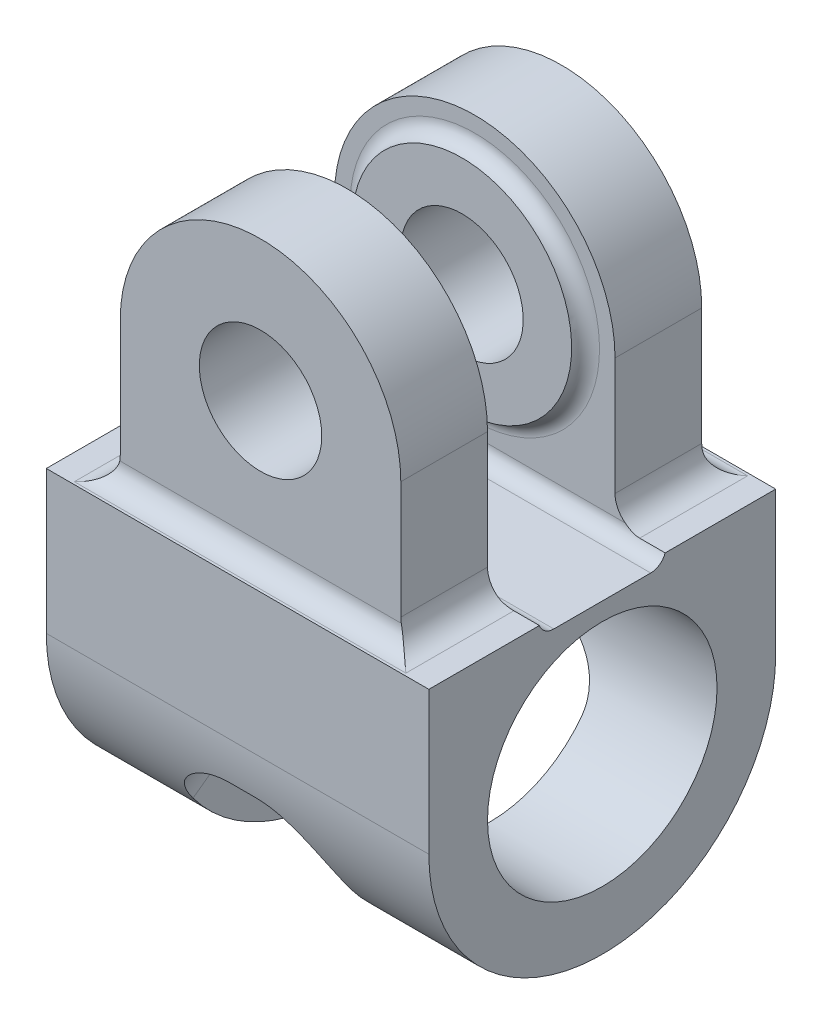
ISO-10303-21;
HEADER;
FILE_DESCRIPTION(('STEP AP214'),'2;1');
FILE_NAME('part.step','',(''),(''),'','','');
FILE_SCHEMA(('AUTOMOTIVE_DESIGN { 1 0 10303 214 1 1 1 1 }'));
ENDSEC;
DATA;
#1=APPLICATION_CONTEXT('core data for automotive mechanical design processes');
#2=APPLICATION_PROTOCOL_DEFINITION('international standard','automotive_design',2000,#1);
#3=PRODUCT_CONTEXT('',#1,'mechanical');
#4=PRODUCT('Part','Part','',(#3));
#5=PRODUCT_RELATED_PRODUCT_CATEGORY('part','',(#4));
#6=PRODUCT_DEFINITION_FORMATION('','',#4);
#7=PRODUCT_DEFINITION_CONTEXT('part definition',#1,'design');
#8=PRODUCT_DEFINITION('design','',#6,#7);
#9=PRODUCT_DEFINITION_SHAPE('','',#8);
#10=(LENGTH_UNIT() NAMED_UNIT(*) SI_UNIT(.MILLI.,.METRE.));
#11=(NAMED_UNIT(*) PLANE_ANGLE_UNIT() SI_UNIT($,.RADIAN.));
#12=(NAMED_UNIT(*) SI_UNIT($,.STERADIAN.) SOLID_ANGLE_UNIT());
#13=UNCERTAINTY_MEASURE_WITH_UNIT(LENGTH_MEASURE(1.E-05),#10,'distance_accuracy_value','');
#14=(GEOMETRIC_REPRESENTATION_CONTEXT(3) GLOBAL_UNCERTAINTY_ASSIGNED_CONTEXT((#13)) GLOBAL_UNIT_ASSIGNED_CONTEXT((#10,
#11,#12)) REPRESENTATION_CONTEXT('',''));
#15=CARTESIAN_POINT('',(0.,0.,0.));
#16=DIRECTION('',(0.,0.,1.));
#17=DIRECTION('',(1.,0.,0.));
#18=AXIS2_PLACEMENT_3D('',#15,#16,#17);
#19=CARTESIAN_POINT('',(0.,0.,80.));
#20=DIRECTION('',(0.,0.,-1.));
#21=DIRECTION('',(-1.,0.,0.));
#22=AXIS2_PLACEMENT_3D('',#19,#20,#21);
#23=CYLINDRICAL_SURFACE('',#22,12.);
#24=CARTESIAN_POINT('',(0.,0.,30.1872763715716));
#25=DIRECTION('',(0.,0.,-1.));
#26=DIRECTION('',(-1.,0.,0.));
#27=AXIS2_PLACEMENT_3D('',#24,#25,#26);
#28=CIRCLE('',#27,12.);
#29=CARTESIAN_POINT('',(-12.,0.,30.1872763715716));
#30=VERTEX_POINT('',#29);
#31=EDGE_CURVE('E732',#30,#30,#28,.T.);
#32=ORIENTED_EDGE('',*,*,#31,.F.);
#33=EDGE_LOOP('',(#32));
#34=FACE_BOUND('',#33,.T.);
#35=CARTESIAN_POINT('',(0.,0.,10.6872763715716));
#36=DIRECTION('',(0.,0.,-1.));
#37=DIRECTION('',(0.,1.,0.));
#38=AXIS2_PLACEMENT_3D('',#35,#36,#37);
#39=CIRCLE('',#38,12.);
#40=CARTESIAN_POINT('',(0.,12.,10.6872763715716));
#41=VERTEX_POINT('',#40);
#42=EDGE_CURVE('E310',#41,#41,#39,.T.);
#43=ORIENTED_EDGE('',*,*,#42,.T.);
#44=EDGE_LOOP('',(#43));
#45=FACE_BOUND('',#44,.T.);
#46=ADVANCED_FACE('F45',(#34,#45),#23,.F.);
#47=CARTESIAN_POINT('',(-52.5,27.5,52.6872763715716));
#48=DIRECTION('',(0.,0.,-1.));
#49=DIRECTION('',(-1.,0.,0.));
#50=AXIS2_PLACEMENT_3D('',#47,#48,#49);
#51=PLANE('',#50);
#52=CARTESIAN_POINT('',(0.,0.,52.6872763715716));
#53=DIRECTION('',(0.,0.,-1.));
#54=DIRECTION('',(-1.,0.,0.));
#55=AXIS2_PLACEMENT_3D('',#52,#53,#54);
#56=CIRCLE('',#55,24.4546377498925);
#57=CARTESIAN_POINT('',(-24.4546377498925,0.,52.6872763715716));
#58=VERTEX_POINT('',#57);
#59=EDGE_CURVE('E53',#58,#58,#56,.F.);
#60=ORIENTED_EDGE('',*,*,#59,.T.);
#61=EDGE_LOOP('',(#60));
#62=FACE_BOUND('',#61,.T.);
#63=CARTESIAN_POINT('',(-32.5,-23.,52.6872763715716));
#64=DIRECTION('',(0.,0.,-1.));
#65=DIRECTION('',(-1.,0.,0.));
#66=AXIS2_PLACEMENT_3D('',#63,#64,#65);
#67=CIRCLE('',#66,5.);
#68=CARTESIAN_POINT('',(-29.5,-27.,52.6872763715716));
#69=VERTEX_POINT('',#68);
#70=CARTESIAN_POINT('',(-27.5,-23.,52.6872763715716));
#71=VERTEX_POINT('',#70);
#72=EDGE_CURVE('E653',#69,#71,#67,.F.);
#73=ORIENTED_EDGE('',*,*,#72,.T.);
#74=DIRECTION('',(0.,1.,0.));
#75=VECTOR('',#74,1.);
#76=CARTESIAN_POINT('',(-27.5,0.,52.6872763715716));
#77=LINE('',#76,#75);
#78=CARTESIAN_POINT('',(-27.5,0.,52.6872763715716));
#79=VERTEX_POINT('',#78);
#80=EDGE_CURVE('E654',#71,#79,#77,.T.);
#81=ORIENTED_EDGE('',*,*,#80,.T.);
#82=CARTESIAN_POINT('',(0.,0.,52.6872763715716));
#83=DIRECTION('',(0.,0.,-1.));
#84=DIRECTION('',(-1.,0.,0.));
#85=AXIS2_PLACEMENT_3D('',#82,#83,#84);
#86=CIRCLE('',#85,27.5);
#87=CARTESIAN_POINT('',(27.5,0.,52.6872763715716));
#88=VERTEX_POINT('',#87);
#89=EDGE_CURVE('E657',#79,#88,#86,.T.);
#90=ORIENTED_EDGE('',*,*,#89,.T.);
#91=DIRECTION('',(0.,-1.,0.));
#92=VECTOR('',#91,1.);
#93=CARTESIAN_POINT('',(27.5,0.,52.6872763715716));
#94=LINE('',#93,#92);
#95=CARTESIAN_POINT('',(27.5,-23.,52.6872763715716));
#96=VERTEX_POINT('',#95);
#97=EDGE_CURVE('E663',#88,#96,#94,.T.);
#98=ORIENTED_EDGE('',*,*,#97,.T.);
#99=CARTESIAN_POINT('',(32.5,-23.,52.6872763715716));
#100=DIRECTION('',(0.,0.,-1.));
#101=DIRECTION('',(-1.,0.,0.));
#102=AXIS2_PLACEMENT_3D('',#99,#100,#101);
#103=CIRCLE('',#102,5.);
#104=CARTESIAN_POINT('',(29.5,-27.,52.6872763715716));
#105=VERTEX_POINT('',#104);
#106=EDGE_CURVE('E661',#96,#105,#103,.F.);
#107=ORIENTED_EDGE('',*,*,#106,.T.);
#108=DIRECTION('',(1.,0.,0.));
#109=VECTOR('',#108,1.);
#110=CARTESIAN_POINT('',(-52.5,-27.,52.6872763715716));
#111=LINE('',#110,#109);
#112=EDGE_CURVE('E309',#69,#105,#111,.T.);
#113=ORIENTED_EDGE('',*,*,#112,.F.);
#114=EDGE_LOOP('',(#73,#81,#90,#98,#107,#113));
#115=FACE_BOUND('',#114,.T.);
#116=ADVANCED_FACE('F585',(#62,#115),#51,.T.);
#117=CARTESIAN_POINT('',(-52.5,27.5,27.6872763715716));
#118=DIRECTION('',(0.,0.,1.));
#119=DIRECTION('',(0.,-1.,0.));
#120=AXIS2_PLACEMENT_3D('',#117,#118,#119);
#121=PLANE('',#120);
#122=CARTESIAN_POINT('',(0.,0.,27.6872763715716));
#123=DIRECTION('',(0.,0.,1.));
#124=DIRECTION('',(0.,-1.,0.));
#125=AXIS2_PLACEMENT_3D('',#122,#123,#124);
#126=CIRCLE('',#125,24.4546377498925);
#127=CARTESIAN_POINT('',(0.,-24.4546377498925,27.6872763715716));
#128=VERTEX_POINT('',#127);
#129=EDGE_CURVE('E14',#128,#128,#126,.F.);
#130=ORIENTED_EDGE('',*,*,#129,.T.);
#131=EDGE_LOOP('',(#130));
#132=FACE_BOUND('',#131,.T.);
#133=CARTESIAN_POINT('',(-32.5,-23.,27.6872763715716));
#134=DIRECTION('',(0.,0.,1.));
#135=DIRECTION('',(0.,-1.,0.));
#136=AXIS2_PLACEMENT_3D('',#133,#134,#135);
#137=CIRCLE('',#136,5.);
#138=CARTESIAN_POINT('',(-27.5,-23.,27.6872763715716));
#139=VERTEX_POINT('',#138);
#140=CARTESIAN_POINT('',(-29.5,-27.,27.6872763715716));
#141=VERTEX_POINT('',#140);
#142=EDGE_CURVE('E665',#139,#141,#137,.F.);
#143=ORIENTED_EDGE('',*,*,#142,.T.);
#144=DIRECTION('',(1.,0.,0.));
#145=VECTOR('',#144,1.);
#146=CARTESIAN_POINT('',(-52.5,-27.,27.6872763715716));
#147=LINE('',#146,#145);
#148=CARTESIAN_POINT('',(29.5,-27.,27.6872763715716));
#149=VERTEX_POINT('',#148);
#150=EDGE_CURVE('E706',#141,#149,#147,.T.);
#151=ORIENTED_EDGE('',*,*,#150,.T.);
#152=CARTESIAN_POINT('',(32.5,-23.,27.6872763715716));
#153=DIRECTION('',(0.,0.,1.));
#154=DIRECTION('',(0.,-1.,0.));
#155=AXIS2_PLACEMENT_3D('',#152,#153,#154);
#156=CIRCLE('',#155,5.);
#157=CARTESIAN_POINT('',(27.5,-23.,27.6872763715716));
#158=VERTEX_POINT('',#157);
#159=EDGE_CURVE('E671',#149,#158,#156,.F.);
#160=ORIENTED_EDGE('',*,*,#159,.T.);
#161=DIRECTION('',(0.,1.,0.));
#162=VECTOR('',#161,1.);
#163=CARTESIAN_POINT('',(27.5,0.,27.6872763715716));
#164=LINE('',#163,#162);
#165=CARTESIAN_POINT('',(27.5,0.,27.6872763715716));
#166=VERTEX_POINT('',#165);
#167=EDGE_CURVE('E673',#158,#166,#164,.T.);
#168=ORIENTED_EDGE('',*,*,#167,.T.);
#169=CARTESIAN_POINT('',(0.,0.,27.6872763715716));
#170=DIRECTION('',(0.,0.,1.));
#171=DIRECTION('',(0.,-1.,0.));
#172=AXIS2_PLACEMENT_3D('',#169,#170,#171);
#173=CIRCLE('',#172,27.5);
#174=CARTESIAN_POINT('',(-27.5,0.,27.6872763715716));
#175=VERTEX_POINT('',#174);
#176=EDGE_CURVE('E669',#166,#175,#173,.T.);
#177=ORIENTED_EDGE('',*,*,#176,.T.);
#178=DIRECTION('',(0.,-1.,0.));
#179=VECTOR('',#178,1.);
#180=CARTESIAN_POINT('',(-27.5,0.,27.6872763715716));
#181=LINE('',#180,#179);
#182=EDGE_CURVE('E667',#175,#139,#181,.T.);
#183=ORIENTED_EDGE('',*,*,#182,.T.);
#184=EDGE_LOOP('',(#143,#151,#160,#168,#177,#183));
#185=FACE_BOUND('',#184,.T.);
#186=ADVANCED_FACE('F367',(#132,#185),#121,.T.);
#187=CARTESIAN_POINT('',(-52.5,27.5,10.6872763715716));
#188=DIRECTION('',(0.,0.,-1.));
#189=DIRECTION('',(0.,1.,0.));
#190=AXIS2_PLACEMENT_3D('',#187,#188,#189);
#191=PLANE('',#190);
#192=ORIENTED_EDGE('',*,*,#42,.F.);
#193=EDGE_LOOP('',(#192));
#194=FACE_BOUND('',#193,.T.);
#195=CARTESIAN_POINT('',(-32.5,-23.,10.6872763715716));
#196=DIRECTION('',(0.,0.,-1.));
#197=DIRECTION('',(0.,1.,0.));
#198=AXIS2_PLACEMENT_3D('',#195,#196,#197);
#199=CIRCLE('',#198,5.);
#200=CARTESIAN_POINT('',(-27.6010205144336,-24.,10.6872763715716));
#201=VERTEX_POINT('',#200);
#202=CARTESIAN_POINT('',(-27.5,-23.,10.6872763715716));
#203=VERTEX_POINT('',#202);
#204=EDGE_CURVE('E676',#201,#203,#199,.F.);
#205=ORIENTED_EDGE('',*,*,#204,.T.);
#206=DIRECTION('',(0.,1.,0.));
#207=VECTOR('',#206,1.);
#208=CARTESIAN_POINT('',(-27.5,0.,10.6872763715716));
#209=LINE('',#208,#207);
#210=CARTESIAN_POINT('',(-27.5,0.,10.6872763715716));
#211=VERTEX_POINT('',#210);
#212=EDGE_CURVE('E678',#203,#211,#209,.T.);
#213=ORIENTED_EDGE('',*,*,#212,.T.);
#214=CARTESIAN_POINT('',(0.,0.,10.6872763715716));
#215=DIRECTION('',(0.,0.,-1.));
#216=DIRECTION('',(0.,1.,0.));
#217=AXIS2_PLACEMENT_3D('',#214,#215,#216);
#218=CIRCLE('',#217,27.5);
#219=CARTESIAN_POINT('',(27.5,0.,10.6872763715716));
#220=VERTEX_POINT('',#219);
#221=EDGE_CURVE('E680',#211,#220,#218,.T.);
#222=ORIENTED_EDGE('',*,*,#221,.T.);
#223=DIRECTION('',(0.,-1.,0.));
#224=VECTOR('',#223,1.);
#225=CARTESIAN_POINT('',(27.5,0.,10.6872763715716));
#226=LINE('',#225,#224);
#227=CARTESIAN_POINT('',(27.5,-23.,10.6872763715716));
#228=VERTEX_POINT('',#227);
#229=EDGE_CURVE('E313',#220,#228,#226,.T.);
#230=ORIENTED_EDGE('',*,*,#229,.T.);
#231=CARTESIAN_POINT('',(32.5,-23.,10.6872763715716));
#232=DIRECTION('',(0.,0.,-1.));
#233=DIRECTION('',(0.,1.,0.));
#234=AXIS2_PLACEMENT_3D('',#231,#232,#233);
#235=CIRCLE('',#234,5.);
#236=CARTESIAN_POINT('',(27.6010205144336,-24.,10.6872763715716));
#237=VERTEX_POINT('',#236);
#238=EDGE_CURVE('E682',#228,#237,#235,.F.);
#239=ORIENTED_EDGE('',*,*,#238,.T.);
#240=DIRECTION('',(1.,0.,0.));
#241=VECTOR('',#240,1.);
#242=CARTESIAN_POINT('',(-52.5,-24.,10.6872763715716));
#243=LINE('',#242,#241);
#244=EDGE_CURVE('E703',#201,#237,#243,.T.);
#245=ORIENTED_EDGE('',*,*,#244,.F.);
#246=EDGE_LOOP('',(#205,#213,#222,#230,#239,#245));
#247=FACE_BOUND('',#246,.T.);
#248=ADVANCED_FACE('F418',(#194,#247),#191,.T.);
#249=CARTESIAN_POINT('',(-52.5,-24.,6.68727637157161));
#250=DIRECTION('',(1.,0.,0.));
#251=DIRECTION('',(0.,1.,0.));
#252=AXIS2_PLACEMENT_3D('',#249,#250,#251);
#253=CYLINDRICAL_SURFACE('',#252,4.);
#254=CARTESIAN_POINT('',(-27.6010205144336,-24.,10.6872763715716));
#255=CARTESIAN_POINT('',(-27.6219581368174,-24.1027017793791,10.6872978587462));
#256=CARTESIAN_POINT('',(-27.6461658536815,-24.2046920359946,10.6833222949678));
#257=CARTESIAN_POINT('',(-27.7007183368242,-24.4063145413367,10.6678632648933));
#258=CARTESIAN_POINT('',(-27.7310558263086,-24.5059494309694,10.656388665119));
#259=CARTESIAN_POINT('',(-27.797210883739,-24.7012719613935,10.62655311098));
#260=CARTESIAN_POINT('',(-27.832975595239,-24.7969874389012,10.6082563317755));
#261=CARTESIAN_POINT('',(-27.9097149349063,-24.984840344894,10.5653405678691));
#262=CARTESIAN_POINT('',(-27.9506909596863,-25.076976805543,10.5407198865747));
#263=CARTESIAN_POINT('',(-28.0802965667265,-25.3464299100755,10.4585127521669));
#264=CARTESIAN_POINT('',(-28.1759740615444,-25.5178634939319,10.3924060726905));
#265=CARTESIAN_POINT('',(-28.3823757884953,-25.8429707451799,10.2419534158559));
#266=CARTESIAN_POINT('',(-28.4931390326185,-25.9965963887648,10.1575598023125));
#267=CARTESIAN_POINT('',(-28.7884681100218,-26.3623429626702,9.92578598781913));
#268=CARTESIAN_POINT('',(-28.980943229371,-26.5620916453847,9.76878540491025));
#269=CARTESIAN_POINT('',(-29.2830960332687,-26.8301146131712,9.51668891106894));
#270=CARTESIAN_POINT('',(-29.3862185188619,-26.9142913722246,9.42974784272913));
#271=CARTESIAN_POINT('',(-29.596226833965,-27.0725124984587,9.25123302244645));
#272=CARTESIAN_POINT('',(-29.7031126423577,-27.146556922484,9.1596592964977));
#273=CARTESIAN_POINT('',(-29.9601841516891,-27.3105047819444,8.93805224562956));
#274=CARTESIAN_POINT('',(-30.111705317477,-27.3960820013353,8.80636857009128));
#275=CARTESIAN_POINT('',(-30.4189902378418,-27.5496051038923,8.53774720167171));
#276=CARTESIAN_POINT('',(-30.5747555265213,-27.6175445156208,8.40080760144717));
#277=CARTESIAN_POINT('',(-30.8891939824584,-27.7364036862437,8.12326032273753));
#278=CARTESIAN_POINT('',(-31.0478643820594,-27.7873388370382,7.98265608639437));
#279=CARTESIAN_POINT('',(-31.3672162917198,-27.8727953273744,7.6989173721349));
#280=CARTESIAN_POINT('',(-31.5278975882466,-27.9073183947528,7.55578316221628));
#281=CARTESIAN_POINT('',(-31.9548549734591,-27.9774728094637,7.17486405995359));
#282=CARTESIAN_POINT('',(-32.2223206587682,-27.9994259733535,6.93564026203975));
#283=CARTESIAN_POINT('',(-32.4929727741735,-27.9999962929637,6.69356171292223));
#284=CARTESIAN_POINT('',(-32.4964864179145,-27.9999999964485,6.69041901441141));
#285=CARTESIAN_POINT('',(-32.5,-28.,6.68727637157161));
#286=B_SPLINE_CURVE_WITH_KNOTS('',3,(#254,#255,#256,#257,#258,#259,#260,#261,#262,#263,#264,
#265,#266,#267,#268,#269,#270,#271,#272,#273,#274,#275,#276,#277,#278,#279,#280,#281,#282,#283,
#284,#285),.UNSPECIFIED.,.F.,.F.,(4,2,2,2,2,2,2,2,2,2,2,2,2,2,2,4),(0.,0.31424904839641,
0.628127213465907,0.939124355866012,1.25020502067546,1.86896258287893,2.48935176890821,
3.43985889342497,3.9165450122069,4.39322845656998,5.04698520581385,5.70098148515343,
6.35438416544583,7.00771804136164,8.08291184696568,8.09705398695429),.UNSPECIFIED.);
#287=CARTESIAN_POINT('',(-32.5,-28.,6.68727637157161));
#288=VERTEX_POINT('',#287);
#289=EDGE_CURVE('E405',#288,#201,#286,.F.);
#290=ORIENTED_EDGE('',*,*,#289,.T.);
#291=ORIENTED_EDGE('',*,*,#244,.T.);
#292=CARTESIAN_POINT('',(27.6010205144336,-24.,10.6872763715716));
#293=CARTESIAN_POINT('',(27.6219581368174,-24.1027017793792,10.6872978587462));
#294=CARTESIAN_POINT('',(27.6461658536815,-24.2046920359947,10.6833222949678));
#295=CARTESIAN_POINT('',(27.7007183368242,-24.4063145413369,10.6678632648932));
#296=CARTESIAN_POINT('',(27.7310558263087,-24.5059494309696,10.656388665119));
#297=CARTESIAN_POINT('',(27.7972108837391,-24.7012719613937,10.6265531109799));
#298=CARTESIAN_POINT('',(27.832975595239,-24.7969874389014,10.6082563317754));
#299=CARTESIAN_POINT('',(27.9097149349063,-24.9848403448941,10.5653405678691));
#300=CARTESIAN_POINT('',(27.9506909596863,-25.0769768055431,10.5407198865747));
#301=CARTESIAN_POINT('',(28.0802965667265,-25.3464299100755,10.458512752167));
#302=CARTESIAN_POINT('',(28.1759740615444,-25.5178634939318,10.3924060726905));
#303=CARTESIAN_POINT('',(28.3823757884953,-25.8429707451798,10.2419534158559));
#304=CARTESIAN_POINT('',(28.4931390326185,-25.9965963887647,10.1575598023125));
#305=CARTESIAN_POINT('',(28.7884681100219,-26.3623429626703,9.92578598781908));
#306=CARTESIAN_POINT('',(28.9809432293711,-26.5620916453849,9.76878540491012));
#307=CARTESIAN_POINT('',(29.2830960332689,-26.8301146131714,9.5166889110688));
#308=CARTESIAN_POINT('',(29.3862185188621,-26.9142913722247,9.42974784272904));
#309=CARTESIAN_POINT('',(29.5962268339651,-27.0725124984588,9.25123302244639));
#310=CARTESIAN_POINT('',(29.7031126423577,-27.146556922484,9.15965929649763));
#311=CARTESIAN_POINT('',(29.9601841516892,-27.3105047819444,8.93805224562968));
#312=CARTESIAN_POINT('',(30.1117053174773,-27.3960820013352,8.80636857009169));
#313=CARTESIAN_POINT('',(30.4189902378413,-27.5496051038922,8.53774720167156));
#314=CARTESIAN_POINT('',(30.5747555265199,-27.6175445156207,8.40080760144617));
#315=CARTESIAN_POINT('',(30.8891939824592,-27.7364036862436,8.12326032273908));
#316=CARTESIAN_POINT('',(31.0478643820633,-27.7873388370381,7.98265608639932));
#317=CARTESIAN_POINT('',(31.3672162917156,-27.8727953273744,7.69891737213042));
#318=CARTESIAN_POINT('',(31.527897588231,-27.9073183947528,7.55578316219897));
#319=CARTESIAN_POINT('',(31.9548549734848,-27.9774728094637,7.17486405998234));
#320=CARTESIAN_POINT('',(32.2223206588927,-27.9994259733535,6.93564026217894));
#321=CARTESIAN_POINT('',(32.4929727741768,-27.9999962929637,6.69356171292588));
#322=CARTESIAN_POINT('',(32.4964864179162,-27.9999999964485,6.69041901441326));
#323=CARTESIAN_POINT('',(32.5,-28.,6.68727637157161));
#324=B_SPLINE_CURVE_WITH_KNOTS('',3,(#292,#293,#294,#295,#296,#297,#298,#299,#300,#301,#302,
#303,#304,#305,#306,#307,#308,#309,#310,#311,#312,#313,#314,#315,#316,#317,#318,#319,#320,#321,
#322,#323),.UNSPECIFIED.,.F.,.F.,(4,2,2,2,2,2,2,2,2,2,2,2,2,2,2,4),(0.,0.314249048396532,
0.628127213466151,0.939124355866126,1.25020502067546,1.86896258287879,2.48935176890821,
3.43985889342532,3.91654501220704,4.39322845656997,5.0469852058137,5.70098148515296,
6.35438416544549,7.00771804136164,8.08291184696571,8.09705398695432),.UNSPECIFIED.);
#325=CARTESIAN_POINT('',(32.5,-28.,6.68727637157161));
#326=VERTEX_POINT('',#325);
#327=EDGE_CURVE('E322',#237,#326,#324,.T.);
#328=ORIENTED_EDGE('',*,*,#327,.T.);
#329=DIRECTION('',(1.,0.,0.));
#330=VECTOR('',#329,1.);
#331=CARTESIAN_POINT('',(-52.5,-28.,6.68727637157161));
#332=LINE('',#331,#330);
#333=EDGE_CURVE('E700',#288,#326,#332,.T.);
#334=ORIENTED_EDGE('',*,*,#333,.F.);
#335=EDGE_LOOP('',(#290,#291,#328,#334));
#336=FACE_BOUND('',#335,.T.);
#337=ADVANCED_FACE('F413',(#336),#253,.F.);
#338=CARTESIAN_POINT('',(-52.5,-28.,6.18727637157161));
#339=DIRECTION('',(0.,0.,-1.));
#340=DIRECTION('',(-1.,0.,0.));
#341=AXIS2_PLACEMENT_3D('',#338,#339,#340);
#342=PLANE('',#341);
#343=DIRECTION('',(0.,1.,0.));
#344=VECTOR('',#343,1.);
#345=CARTESIAN_POINT('',(-37.5,-28.,6.18727637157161));
#346=LINE('',#345,#344);
#347=CARTESIAN_POINT('',(-37.5,-56.,6.18727637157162));
#348=VERTEX_POINT('',#347);
#349=CARTESIAN_POINT('',(-37.5,-28.,6.18727637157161));
#350=VERTEX_POINT('',#349);
#351=EDGE_CURVE('E412',#348,#350,#346,.T.);
#352=ORIENTED_EDGE('',*,*,#351,.T.);
#353=DIRECTION('',(1.,0.,0.));
#354=VECTOR('',#353,1.);
#355=CARTESIAN_POINT('',(-52.5,-28.,6.18727637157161));
#356=LINE('',#355,#354);
#357=CARTESIAN_POINT('',(37.5,-28.,6.18727637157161));
#358=VERTEX_POINT('',#357);
#359=EDGE_CURVE('E697',#350,#358,#356,.T.);
#360=ORIENTED_EDGE('',*,*,#359,.T.);
#361=DIRECTION('',(0.,1.,0.));
#362=VECTOR('',#361,1.);
#363=CARTESIAN_POINT('',(37.5,-28.,6.18727637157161));
#364=LINE('',#363,#362);
#365=CARTESIAN_POINT('',(37.5,-56.,6.18727637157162));
#366=VERTEX_POINT('',#365);
#367=EDGE_CURVE('E720',#366,#358,#364,.T.);
#368=ORIENTED_EDGE('',*,*,#367,.F.);
#369=DIRECTION('',(1.,0.,0.));
#370=VECTOR('',#369,1.);
#371=CARTESIAN_POINT('',(-52.5,-56.,6.18727637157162));
#372=LINE('',#371,#370);
#373=EDGE_CURVE('E694',#348,#366,#372,.T.);
#374=ORIENTED_EDGE('',*,*,#373,.F.);
#375=EDGE_LOOP('',(#352,#360,#368,#374));
#376=FACE_BOUND('',#375,.T.);
#377=ADVANCED_FACE('F417',(#376),#342,.T.);
#378=CARTESIAN_POINT('',(-52.5,27.5,69.6872763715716));
#379=DIRECTION('',(0.,0.,1.));
#380=DIRECTION('',(1.,0.,0.));
#381=AXIS2_PLACEMENT_3D('',#378,#379,#380);
#382=PLANE('',#381);
#383=CARTESIAN_POINT('',(0.,0.,69.6872763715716));
#384=DIRECTION('',(0.,0.,1.));
#385=DIRECTION('',(1.,0.,0.));
#386=AXIS2_PLACEMENT_3D('',#383,#384,#385);
#387=CIRCLE('',#386,12.);
#388=CARTESIAN_POINT('',(12.,0.,69.6872763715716));
#389=VERTEX_POINT('',#388);
#390=EDGE_CURVE('E305',#389,#389,#387,.T.);
#391=ORIENTED_EDGE('',*,*,#390,.F.);
#392=EDGE_LOOP('',(#391));
#393=FACE_BOUND('',#392,.T.);
#394=CARTESIAN_POINT('',(-32.5,-23.,69.6872763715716));
#395=DIRECTION('',(0.,0.,1.));
#396=DIRECTION('',(1.,0.,0.));
#397=AXIS2_PLACEMENT_3D('',#394,#395,#396);
#398=CIRCLE('',#397,5.);
#399=CARTESIAN_POINT('',(-27.5,-23.,69.6872763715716));
#400=VERTEX_POINT('',#399);
#401=CARTESIAN_POINT('',(-27.6010205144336,-24.,69.6872763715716));
#402=VERTEX_POINT('',#401);
#403=EDGE_CURVE('E314',#400,#402,#398,.F.);
#404=ORIENTED_EDGE('',*,*,#403,.T.);
#405=DIRECTION('',(1.,0.,0.));
#406=VECTOR('',#405,1.);
#407=CARTESIAN_POINT('',(-52.5,-24.,69.6872763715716));
#408=LINE('',#407,#406);
#409=CARTESIAN_POINT('',(27.6010205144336,-24.,69.6872763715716));
#410=VERTEX_POINT('',#409);
#411=EDGE_CURVE('E639',#402,#410,#408,.T.);
#412=ORIENTED_EDGE('',*,*,#411,.T.);
#413=CARTESIAN_POINT('',(32.5,-23.,69.6872763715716));
#414=DIRECTION('',(0.,0.,1.));
#415=DIRECTION('',(1.,0.,0.));
#416=AXIS2_PLACEMENT_3D('',#413,#414,#415);
#417=CIRCLE('',#416,5.);
#418=CARTESIAN_POINT('',(27.5,-23.,69.6872763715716));
#419=VERTEX_POINT('',#418);
#420=EDGE_CURVE('E688',#410,#419,#417,.F.);
#421=ORIENTED_EDGE('',*,*,#420,.T.);
#422=DIRECTION('',(0.,1.,0.));
#423=VECTOR('',#422,1.);
#424=CARTESIAN_POINT('',(27.5,0.,69.6872763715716));
#425=LINE('',#424,#423);
#426=CARTESIAN_POINT('',(27.5,0.,69.6872763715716));
#427=VERTEX_POINT('',#426);
#428=EDGE_CURVE('E308',#419,#427,#425,.T.);
#429=ORIENTED_EDGE('',*,*,#428,.T.);
#430=CARTESIAN_POINT('',(0.,0.,69.6872763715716));
#431=DIRECTION('',(0.,0.,1.));
#432=DIRECTION('',(1.,0.,0.));
#433=AXIS2_PLACEMENT_3D('',#430,#431,#432);
#434=CIRCLE('',#433,27.5);
#435=CARTESIAN_POINT('',(-27.5,0.,69.6872763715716));
#436=VERTEX_POINT('',#435);
#437=EDGE_CURVE('E686',#427,#436,#434,.T.);
#438=ORIENTED_EDGE('',*,*,#437,.T.);
#439=DIRECTION('',(0.,-1.,0.));
#440=VECTOR('',#439,1.);
#441=CARTESIAN_POINT('',(-27.5,0.,69.6872763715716));
#442=LINE('',#441,#440);
#443=EDGE_CURVE('E641',#436,#400,#442,.T.);
#444=ORIENTED_EDGE('',*,*,#443,.T.);
#445=EDGE_LOOP('',(#404,#412,#421,#429,#438,#444));
#446=FACE_BOUND('',#445,.T.);
#447=ADVANCED_FACE('F423',(#393,#446),#382,.T.);
#448=CARTESIAN_POINT('',(-52.5,-24.,73.6872763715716));
#449=DIRECTION('',(1.,0.,0.));
#450=DIRECTION('',(0.,1.,0.));
#451=AXIS2_PLACEMENT_3D('',#448,#449,#450);
#452=CYLINDRICAL_SURFACE('',#451,4.);
#453=CARTESIAN_POINT('',(-27.6010205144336,-24.,69.6872763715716));
#454=CARTESIAN_POINT('',(-27.6219581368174,-24.1027017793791,69.687254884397));
#455=CARTESIAN_POINT('',(-27.6461658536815,-24.2046920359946,69.6912304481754));
#456=CARTESIAN_POINT('',(-27.7007183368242,-24.4063145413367,69.70668947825));
#457=CARTESIAN_POINT('',(-27.7310558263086,-24.5059494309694,69.7181640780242));
#458=CARTESIAN_POINT('',(-27.797210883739,-24.7012719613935,69.7479996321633));
#459=CARTESIAN_POINT('',(-27.832975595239,-24.7969874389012,69.7662964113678));
#460=CARTESIAN_POINT('',(-27.9097149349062,-24.984840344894,69.8092121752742));
#461=CARTESIAN_POINT('',(-27.9506909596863,-25.076976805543,69.8338328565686));
#462=CARTESIAN_POINT('',(-28.0802965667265,-25.3464299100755,69.9160399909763));
#463=CARTESIAN_POINT('',(-28.1759740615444,-25.5178634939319,69.9821466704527));
#464=CARTESIAN_POINT('',(-28.3823757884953,-25.8429707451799,70.1325993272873));
#465=CARTESIAN_POINT('',(-28.4931390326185,-25.9965963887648,70.2169929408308));
#466=CARTESIAN_POINT('',(-28.7884681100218,-26.3623429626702,70.4487667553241));
#467=CARTESIAN_POINT('',(-28.980943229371,-26.5620916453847,70.605767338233));
#468=CARTESIAN_POINT('',(-29.2830960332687,-26.8301146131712,70.8578638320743));
#469=CARTESIAN_POINT('',(-29.3862185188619,-26.9142913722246,70.9448049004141));
#470=CARTESIAN_POINT('',(-29.596226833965,-27.0725124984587,71.1233197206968));
#471=CARTESIAN_POINT('',(-29.7031126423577,-27.146556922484,71.2148934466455));
#472=CARTESIAN_POINT('',(-29.9601841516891,-27.3105047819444,71.4365004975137));
#473=CARTESIAN_POINT('',(-30.111705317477,-27.3960820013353,71.568184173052));
#474=CARTESIAN_POINT('',(-30.4189902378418,-27.5496051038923,71.8368055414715));
#475=CARTESIAN_POINT('',(-30.5747555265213,-27.6175445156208,71.9737451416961));
#476=CARTESIAN_POINT('',(-30.8891939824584,-27.7364036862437,72.2512924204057));
#477=CARTESIAN_POINT('',(-31.0478643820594,-27.7873388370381,72.3918966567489));
#478=CARTESIAN_POINT('',(-31.3672162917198,-27.8727953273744,72.6756353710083));
#479=CARTESIAN_POINT('',(-31.5278975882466,-27.9073183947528,72.8187695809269));
#480=CARTESIAN_POINT('',(-31.9548549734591,-27.9774728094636,73.1996886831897));
#481=CARTESIAN_POINT('',(-32.2223206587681,-27.9994259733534,73.4389124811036));
#482=CARTESIAN_POINT('',(-32.4929727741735,-27.9999962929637,73.680991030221));
#483=CARTESIAN_POINT('',(-32.4964864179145,-27.9999999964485,73.6841337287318));
#484=CARTESIAN_POINT('',(-32.5,-28.,73.6872763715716));
#485=B_SPLINE_CURVE_WITH_KNOTS('',3,(#453,#454,#455,#456,#457,#458,#459,#460,#461,#462,#463,
#464,#465,#466,#467,#468,#469,#470,#471,#472,#473,#474,#475,#476,#477,#478,#479,#480,#481,#482,
#483,#484),.UNSPECIFIED.,.F.,.F.,(4,2,2,2,2,2,2,2,2,2,2,2,2,2,2,4),(0.,0.31424904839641,
0.628127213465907,0.93912435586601,1.25020502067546,1.86896258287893,2.48935176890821,
3.43985889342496,3.91654501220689,4.39322845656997,5.04698520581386,5.70098148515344,
6.35438416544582,7.00771804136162,8.08291184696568,8.09705398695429),.UNSPECIFIED.);
#486=CARTESIAN_POINT('',(-32.5,-28.,73.6872763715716));
#487=VERTEX_POINT('',#486);
#488=EDGE_CURVE('E396',#402,#487,#485,.T.);
#489=ORIENTED_EDGE('',*,*,#488,.T.);
#490=DIRECTION('',(1.,0.,0.));
#491=VECTOR('',#490,1.);
#492=CARTESIAN_POINT('',(-52.5,-28.,73.6872763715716));
#493=LINE('',#492,#491);
#494=CARTESIAN_POINT('',(32.5,-28.,73.6872763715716));
#495=VERTEX_POINT('',#494);
#496=EDGE_CURVE('E267',#487,#495,#493,.T.);
#497=ORIENTED_EDGE('',*,*,#496,.T.);
#498=CARTESIAN_POINT('',(27.6010205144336,-24.,69.6872763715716));
#499=CARTESIAN_POINT('',(27.6219581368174,-24.1027017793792,69.687254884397));
#500=CARTESIAN_POINT('',(27.6461658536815,-24.2046920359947,69.6912304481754));
#501=CARTESIAN_POINT('',(27.7007183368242,-24.4063145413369,69.70668947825));
#502=CARTESIAN_POINT('',(27.7310558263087,-24.5059494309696,69.7181640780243));
#503=CARTESIAN_POINT('',(27.7972108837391,-24.7012719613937,69.7479996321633));
#504=CARTESIAN_POINT('',(27.832975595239,-24.7969874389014,69.7662964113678));
#505=CARTESIAN_POINT('',(27.9097149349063,-24.9848403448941,69.8092121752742));
#506=CARTESIAN_POINT('',(27.9506909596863,-25.0769768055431,69.8338328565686));
#507=CARTESIAN_POINT('',(28.0802965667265,-25.3464299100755,69.9160399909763));
#508=CARTESIAN_POINT('',(28.1759740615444,-25.5178634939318,69.9821466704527));
#509=CARTESIAN_POINT('',(28.3823757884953,-25.8429707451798,70.1325993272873));
#510=CARTESIAN_POINT('',(28.4931390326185,-25.9965963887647,70.2169929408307));
#511=CARTESIAN_POINT('',(28.7884681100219,-26.3623429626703,70.4487667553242));
#512=CARTESIAN_POINT('',(28.9809432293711,-26.5620916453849,70.6057673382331));
#513=CARTESIAN_POINT('',(29.2830960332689,-26.8301146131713,70.8578638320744));
#514=CARTESIAN_POINT('',(29.3862185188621,-26.9142913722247,70.9448049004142));
#515=CARTESIAN_POINT('',(29.5962268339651,-27.0725124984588,71.1233197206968));
#516=CARTESIAN_POINT('',(29.7031126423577,-27.146556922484,71.2148934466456));
#517=CARTESIAN_POINT('',(29.9601841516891,-27.3105047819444,71.4365004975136));
#518=CARTESIAN_POINT('',(30.1117053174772,-27.3960820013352,71.5681841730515));
#519=CARTESIAN_POINT('',(30.4189902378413,-27.5496051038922,71.8368055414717));
#520=CARTESIAN_POINT('',(30.5747555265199,-27.6175445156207,71.9737451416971));
#521=CARTESIAN_POINT('',(30.8891939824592,-27.7364036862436,72.2512924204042));
#522=CARTESIAN_POINT('',(31.0478643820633,-27.7873388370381,72.3918966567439));
#523=CARTESIAN_POINT('',(31.3672162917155,-27.8727953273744,72.6756353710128));
#524=CARTESIAN_POINT('',(31.527897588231,-27.9073183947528,72.8187695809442));
#525=CARTESIAN_POINT('',(31.9548549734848,-27.9774728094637,73.1996886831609));
#526=CARTESIAN_POINT('',(32.2223206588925,-27.9994259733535,73.4389124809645));
#527=CARTESIAN_POINT('',(32.4929727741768,-27.9999962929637,73.6809910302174));
#528=CARTESIAN_POINT('',(32.4964864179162,-27.9999999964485,73.68413372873));
#529=CARTESIAN_POINT('',(32.5,-28.,73.6872763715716));
#530=B_SPLINE_CURVE_WITH_KNOTS('',3,(#498,#499,#500,#501,#502,#503,#504,#505,#506,#507,#508,
#509,#510,#511,#512,#513,#514,#515,#516,#517,#518,#519,#520,#521,#522,#523,#524,#525,#526,#527,
#528,#529),.UNSPECIFIED.,.F.,.F.,(4,2,2,2,2,2,2,2,2,2,2,2,2,2,2,4),(0.,0.314249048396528,
0.628127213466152,0.939124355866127,1.25020502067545,1.86896258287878,2.4893517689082,
3.43985889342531,3.91654501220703,4.39322845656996,5.04698520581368,5.70098148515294,
6.35438416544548,7.00771804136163,8.08291184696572,8.09705398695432),.UNSPECIFIED.);
#531=EDGE_CURVE('E315',#495,#410,#530,.F.);
#532=ORIENTED_EDGE('',*,*,#531,.T.);
#533=ORIENTED_EDGE('',*,*,#411,.F.);
#534=EDGE_LOOP('',(#489,#497,#532,#533));
#535=FACE_BOUND('',#534,.T.);
#536=ADVANCED_FACE('F328',(#535),#452,.F.);
#537=CARTESIAN_POINT('',(-52.5,-28.,74.1872763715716));
#538=DIRECTION('',(0.,0.,1.));
#539=DIRECTION('',(1.,0.,0.));
#540=AXIS2_PLACEMENT_3D('',#537,#538,#539);
#541=PLANE('',#540);
#542=DIRECTION('',(0.,-1.,0.));
#543=VECTOR('',#542,1.);
#544=CARTESIAN_POINT('',(-37.5,-28.,74.1872763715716));
#545=LINE('',#544,#543);
#546=CARTESIAN_POINT('',(-37.5,-28.,74.1872763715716));
#547=VERTEX_POINT('',#546);
#548=CARTESIAN_POINT('',(-37.5,-56.,74.1872763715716));
#549=VERTEX_POINT('',#548);
#550=EDGE_CURVE('E652',#547,#549,#545,.T.);
#551=ORIENTED_EDGE('',*,*,#550,.T.);
#552=DIRECTION('',(1.,0.,0.));
#553=VECTOR('',#552,1.);
#554=CARTESIAN_POINT('',(-52.5,-56.,74.1872763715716));
#555=LINE('',#554,#553);
#556=CARTESIAN_POINT('',(37.5,-56.,74.1872763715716));
#557=VERTEX_POINT('',#556);
#558=EDGE_CURVE('E266',#549,#557,#555,.T.);
#559=ORIENTED_EDGE('',*,*,#558,.T.);
#560=DIRECTION('',(0.,-1.,0.));
#561=VECTOR('',#560,1.);
#562=CARTESIAN_POINT('',(37.5,-28.,74.1872763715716));
#563=LINE('',#562,#561);
#564=CARTESIAN_POINT('',(37.5,-28.,74.1872763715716));
#565=VERTEX_POINT('',#564);
#566=EDGE_CURVE('E270',#565,#557,#563,.T.);
#567=ORIENTED_EDGE('',*,*,#566,.F.);
#568=DIRECTION('',(1.,0.,0.));
#569=VECTOR('',#568,1.);
#570=CARTESIAN_POINT('',(-52.5,-28.,74.1872763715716));
#571=LINE('',#570,#569);
#572=EDGE_CURVE('E255',#547,#565,#571,.T.);
#573=ORIENTED_EDGE('',*,*,#572,.F.);
#574=EDGE_LOOP('',(#551,#559,#567,#573));
#575=FACE_BOUND('',#574,.T.);
#576=ADVANCED_FACE('F271',(#575),#541,.T.);
#577=CARTESIAN_POINT('',(-52.5,-56.,40.1872763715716));
#578=DIRECTION('',(1.,0.,0.));
#579=DIRECTION('',(0.,1.,0.));
#580=AXIS2_PLACEMENT_3D('',#577,#578,#579);
#581=CYLINDRICAL_SURFACE('',#580,34.);
#582=CARTESIAN_POINT('',(-15.5,-56.,40.1872763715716));
#583=DIRECTION('',(-1.,0.,0.));
#584=DIRECTION('',(0.,0.,1.));
#585=AXIS2_PLACEMENT_3D('',#582,#583,#584);
#586=CIRCLE('',#585,34.);
#587=CARTESIAN_POINT('',(-15.5,-76.3552067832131,67.4208137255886));
#588=VERTEX_POINT('',#587);
#589=CARTESIAN_POINT('',(-15.5,-76.3552067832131,12.9537390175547));
#590=VERTEX_POINT('',#589);
#591=EDGE_CURVE('E727',#588,#590,#586,.F.);
#592=ORIENTED_EDGE('',*,*,#591,.F.);
#593=CARTESIAN_POINT('',(-15.5,-76.3552067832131,67.4208137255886));
#594=CARTESIAN_POINT('',(-15.5000005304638,-76.2145854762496,67.5259206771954));
#595=CARTESIAN_POINT('',(-15.4964436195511,-76.0731658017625,67.6299218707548));
#596=CARTESIAN_POINT('',(-15.4822261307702,-75.7889739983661,67.8355539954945));
#597=CARTESIAN_POINT('',(-15.4715657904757,-75.6462019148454,67.937185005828));
#598=CARTESIAN_POINT('',(-15.4289596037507,-75.216345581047,68.2381996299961));
#599=CARTESIAN_POINT('',(-15.3863885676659,-74.9275870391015,68.4338051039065));
#600=CARTESIAN_POINT('',(-15.2734936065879,-74.3490464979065,68.8129956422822));
#601=CARTESIAN_POINT('',(-15.2032595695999,-74.059270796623,68.9966174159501));
#602=CARTESIAN_POINT('',(-15.0356860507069,-73.480076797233,69.3516774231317));
#603=CARTESIAN_POINT('',(-14.9383457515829,-73.1906585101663,69.5231152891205));
#604=CARTESIAN_POINT('',(-14.7174937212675,-72.614732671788,69.8530944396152));
#605=CARTESIAN_POINT('',(-14.5939970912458,-72.3282235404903,70.0116430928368));
#606=CARTESIAN_POINT('',(-14.3218228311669,-71.7602493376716,70.3156402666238));
#607=CARTESIAN_POINT('',(-14.1731436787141,-71.4787845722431,70.461087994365));
#608=CARTESIAN_POINT('',(-13.8516666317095,-70.9230212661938,70.7388722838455));
#609=CARTESIAN_POINT('',(-13.6788552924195,-70.6487268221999,70.871201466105));
#610=CARTESIAN_POINT('',(-13.3103982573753,-70.1096531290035,71.1227928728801));
#611=CARTESIAN_POINT('',(-13.114752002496,-69.844874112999,71.2420547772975));
#612=CARTESIAN_POINT('',(-12.6942548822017,-69.3173727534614,71.4719915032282));
#613=CARTESIAN_POINT('',(-12.4685917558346,-69.0550882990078,71.5821858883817));
#614=CARTESIAN_POINT('',(-11.9954457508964,-68.5452496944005,71.7893722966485));
#615=CARTESIAN_POINT('',(-11.7479558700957,-68.2977003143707,71.8863600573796));
#616=CARTESIAN_POINT('',(-11.232642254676,-67.8196152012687,72.0677105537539));
#617=CARTESIAN_POINT('',(-10.964814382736,-67.589082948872,72.1520707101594));
#618=CARTESIAN_POINT('',(-10.4103933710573,-67.1472890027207,72.3088096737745));
#619=CARTESIAN_POINT('',(-10.1237993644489,-66.9360282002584,72.3811879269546));
#620=CARTESIAN_POINT('',(-9.52121557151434,-66.5266351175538,72.5174235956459));
#621=CARTESIAN_POINT('',(-9.20449955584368,-66.3294109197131,72.5808030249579));
#622=CARTESIAN_POINT('',(-8.55457724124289,-65.9607068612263,72.6960695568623));
#623=CARTESIAN_POINT('',(-8.22137730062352,-65.7892171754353,72.7479610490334));
#624=CARTESIAN_POINT('',(-7.54084234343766,-65.4743098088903,72.8409806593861));
#625=CARTESIAN_POINT('',(-7.19351892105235,-65.3308696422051,72.8821174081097));
#626=CARTESIAN_POINT('',(-6.48697160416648,-65.0740194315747,72.9543330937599));
#627=CARTESIAN_POINT('',(-6.12775070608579,-64.9606018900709,72.9854145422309));
#628=CARTESIAN_POINT('',(-5.49870232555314,-64.7919904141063,73.0309407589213));
#629=CARTESIAN_POINT('',(-5.23100664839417,-64.7293466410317,73.047611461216));
#630=CARTESIAN_POINT('',(-4.69190259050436,-64.6215254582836,73.0760647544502));
#631=CARTESIAN_POINT('',(-4.42049501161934,-64.5763443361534,73.0878483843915));
#632=CARTESIAN_POINT('',(-3.87492724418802,-64.5038445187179,73.1066644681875));
#633=CARTESIAN_POINT('',(-3.60076508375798,-64.4765397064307,73.1136932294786));
#634=CARTESIAN_POINT('',(-3.05107217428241,-64.4400689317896,73.1230516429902));
#635=CARTESIAN_POINT('',(-2.77554102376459,-64.4309086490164,73.1253798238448));
#636=CARTESIAN_POINT('',(-2.5,-64.4309395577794,73.1253889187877));
#637=B_SPLINE_CURVE_WITH_KNOTS('',3,(#593,#594,#595,#596,#597,#598,#599,#600,#601,#602,#603,
#604,#605,#606,#607,#608,#609,#610,#611,#612,#613,#614,#615,#616,#617,#618,#619,#620,#621,#622,
#623,#624,#625,#626,#627,#628,#629,#630,#631,#632,#633,#634,#635,#636),.UNSPECIFIED.,.F.,.F.,(4,
2,2,2,2,2,2,2,2,2,2,2,2,2,2,2,2,2,2,2,2,4),(0.,0.526598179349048,1.05317874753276,
2.10583900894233,3.15510661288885,4.20440585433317,5.2531009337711,6.3018594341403,
7.35120457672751,8.40057541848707,9.4887395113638,10.5772539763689,11.6659904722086,
12.7547772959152,13.888727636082,15.0222439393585,16.1548477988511,17.2871685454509,
18.1128899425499,18.9384356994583,19.7646218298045,20.5910665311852),.UNSPECIFIED.);
#638=CARTESIAN_POINT('',(-2.50000000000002,-64.4309395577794,73.1253889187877));
#639=VERTEX_POINT('',#638);
#640=EDGE_CURVE('E449',#588,#639,#637,.T.);
#641=ORIENTED_EDGE('',*,*,#640,.T.);
#642=DIRECTION('',(1.,0.,0.));
#643=VECTOR('',#642,1.);
#644=CARTESIAN_POINT('',(-52.5,-64.4309395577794,73.1253889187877));
#645=LINE('',#644,#643);
#646=CARTESIAN_POINT('',(2.49999999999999,-64.4309395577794,73.1253889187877));
#647=VERTEX_POINT('',#646);
#648=EDGE_CURVE('E725',#647,#639,#645,.F.);
#649=ORIENTED_EDGE('',*,*,#648,.F.);
#650=CARTESIAN_POINT('',(2.5,-64.4309395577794,73.1253889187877));
#651=CARTESIAN_POINT('',(2.6761824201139,-64.4309376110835,73.1253872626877));
#652=CARTESIAN_POINT('',(2.85234174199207,-64.4346732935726,73.1244334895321));
#653=CARTESIAN_POINT('',(3.20431787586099,-64.449591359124,73.120610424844));
#654=CARTESIAN_POINT('',(3.38013469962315,-64.4607734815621,73.1177412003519));
#655=CARTESIAN_POINT('',(3.90645201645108,-64.5054306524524,73.1062475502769));
#656=CARTESIAN_POINT('',(4.25601421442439,-64.550016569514,73.09473717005));
#657=CARTESIAN_POINT('',(4.94856774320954,-64.667914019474,73.0638779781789));
#658=CARTESIAN_POINT('',(5.29157799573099,-64.7411230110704,73.0445571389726));
#659=CARTESIAN_POINT('',(5.96996039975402,-64.9151857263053,72.9977560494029));
#660=CARTESIAN_POINT('',(6.3053321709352,-65.0160408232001,72.9702753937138));
#661=CARTESIAN_POINT('',(6.96582842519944,-65.2438617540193,72.9067655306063));
#662=CARTESIAN_POINT('',(7.29096350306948,-65.3707994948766,72.8707455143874));
#663=CARTESIAN_POINT('',(7.92948625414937,-65.6492667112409,72.7896179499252));
#664=CARTESIAN_POINT('',(8.24286940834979,-65.8008055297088,72.7445069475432));
#665=CARTESIAN_POINT('',(8.85606672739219,-66.1267071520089,72.644615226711));
#666=CARTESIAN_POINT('',(9.15587577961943,-66.3010784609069,72.5898309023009));
#667=CARTESIAN_POINT('',(9.7402949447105,-66.6707926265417,72.4699645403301));
#668=CARTESIAN_POINT('',(10.0248979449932,-66.8661451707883,72.4048777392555));
#669=CARTESIAN_POINT('',(10.589330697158,-67.2847715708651,72.2607084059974));
#670=CARTESIAN_POINT('',(10.8684080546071,-67.5088926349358,72.1811384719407));
#671=CARTESIAN_POINT('',(11.406477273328,-67.9754372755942,72.0094486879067));
#672=CARTESIAN_POINT('',(11.6654772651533,-68.2178533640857,71.917333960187));
#673=CARTESIAN_POINT('',(12.1621304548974,-68.718934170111,71.7198193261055));
#674=CARTESIAN_POINT('',(12.3997708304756,-68.977608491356,71.6144115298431));
#675=CARTESIAN_POINT('',(12.8519396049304,-69.5086331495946,71.3898386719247));
#676=CARTESIAN_POINT('',(13.0664767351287,-69.7809782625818,71.2706788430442));
#677=CARTESIAN_POINT('',(13.4773781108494,-70.3457012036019,71.0142122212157));
#678=CARTESIAN_POINT('',(13.6729688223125,-70.6384387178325,70.8764560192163));
#679=CARTESIAN_POINT('',(14.0365762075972,-71.2333053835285,70.5855660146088));
#680=CARTESIAN_POINT('',(14.2045907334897,-71.5354352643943,70.4324310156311));
#681=CARTESIAN_POINT('',(14.5114107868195,-72.1459585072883,70.1109615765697));
#682=CARTESIAN_POINT('',(14.6502426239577,-72.4543459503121,69.9426410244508));
#683=CARTESIAN_POINT('',(14.8975325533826,-73.0746986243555,69.5910460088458));
#684=CARTESIAN_POINT('',(15.0059984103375,-73.3866629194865,69.407775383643));
#685=CARTESIAN_POINT('',(15.1651162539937,-73.9224537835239,69.0811215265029));
#686=CARTESIAN_POINT('',(15.2234387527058,-74.1461448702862,68.9411956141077));
#687=CARTESIAN_POINT('',(15.3236485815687,-74.5927451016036,68.654454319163));
#688=CARTESIAN_POINT('',(15.3655394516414,-74.8156544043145,68.5076404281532));
#689=CARTESIAN_POINT('',(15.4326683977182,-75.2597262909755,68.2075316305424));
#690=CARTESIAN_POINT('',(15.4579004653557,-75.4808882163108,68.0542344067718));
#691=CARTESIAN_POINT('',(15.4915776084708,-75.9204176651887,67.7417681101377));
#692=CARTESIAN_POINT('',(15.500017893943,-76.138784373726,67.5825973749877));
#693=CARTESIAN_POINT('',(15.5,-76.3552067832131,67.4208137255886));
#694=B_SPLINE_CURVE_WITH_KNOTS('',3,(#650,#651,#652,#653,#654,#655,#656,#657,#658,#659,#660,
#661,#662,#663,#664,#665,#666,#667,#668,#669,#670,#671,#672,#673,#674,#675,#676,#677,#678,#679,
#680,#681,#682,#683,#684,#685,#686,#687,#688,#689,#690,#691,#692,#693),.UNSPECIFIED.,.F.,.F.,(4,
2,2,2,2,2,2,2,2,2,2,2,2,2,2,2,2,2,2,2,2,4),(0.,0.52845921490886,1.05689993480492,
2.11319881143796,3.16574770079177,4.21834888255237,5.26982221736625,6.32169581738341,
7.37396235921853,8.42671686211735,9.52548738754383,10.6238106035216,11.7227888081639,
12.82135021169,13.954106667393,15.0869513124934,16.2187702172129,17.3502994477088,
18.1604133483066,18.9703526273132,19.7805838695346,20.5910462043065),.UNSPECIFIED.);
#695=CARTESIAN_POINT('',(15.5,-76.3552067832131,67.4208137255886));
#696=VERTEX_POINT('',#695);
#697=EDGE_CURVE('E475',#647,#696,#694,.T.);
#698=ORIENTED_EDGE('',*,*,#697,.T.);
#699=CARTESIAN_POINT('',(15.5,-56.,40.1872763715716));
#700=DIRECTION('',(-1.,0.,0.));
#701=DIRECTION('',(0.,0.,1.));
#702=AXIS2_PLACEMENT_3D('',#699,#700,#701);
#703=CIRCLE('',#702,34.);
#704=CARTESIAN_POINT('',(15.5,-76.3552067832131,12.9537390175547));
#705=VERTEX_POINT('',#704);
#706=EDGE_CURVE('E730',#696,#705,#703,.F.);
#707=ORIENTED_EDGE('',*,*,#706,.T.);
#708=CARTESIAN_POINT('',(15.5,-76.3552067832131,12.9537390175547));
#709=CARTESIAN_POINT('',(15.5000005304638,-76.2145854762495,12.8486320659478));
#710=CARTESIAN_POINT('',(15.4964436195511,-76.0731658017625,12.7446308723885));
#711=CARTESIAN_POINT('',(15.4822261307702,-75.788973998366,12.5389987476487));
#712=CARTESIAN_POINT('',(15.4715657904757,-75.6462019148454,12.4373677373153));
#713=CARTESIAN_POINT('',(15.4289596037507,-75.216345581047,12.1363531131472));
#714=CARTESIAN_POINT('',(15.3863885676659,-74.9275870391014,11.9407476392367));
#715=CARTESIAN_POINT('',(15.2734936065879,-74.3490464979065,11.561557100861));
#716=CARTESIAN_POINT('',(15.2032595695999,-74.059270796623,11.3779353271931));
#717=CARTESIAN_POINT('',(15.0356860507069,-73.480076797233,11.0228753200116));
#718=CARTESIAN_POINT('',(14.9383457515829,-73.1906585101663,10.8514374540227));
#719=CARTESIAN_POINT('',(14.7174937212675,-72.614732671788,10.521458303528));
#720=CARTESIAN_POINT('',(14.5939970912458,-72.3282235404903,10.3629096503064));
#721=CARTESIAN_POINT('',(14.3218228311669,-71.7602493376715,10.0589124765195));
#722=CARTESIAN_POINT('',(14.1731436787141,-71.4787845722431,9.91346474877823));
#723=CARTESIAN_POINT('',(13.8516666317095,-70.9230212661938,9.63568045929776));
#724=CARTESIAN_POINT('',(13.6788552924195,-70.6487268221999,9.50335127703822));
#725=CARTESIAN_POINT('',(13.3103982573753,-70.1096531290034,9.2517598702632));
#726=CARTESIAN_POINT('',(13.114752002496,-69.844874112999,9.13249796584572));
#727=CARTESIAN_POINT('',(12.6942548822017,-69.3173727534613,8.90256123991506));
#728=CARTESIAN_POINT('',(12.4685917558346,-69.0550882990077,8.79236685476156));
#729=CARTESIAN_POINT('',(11.9954457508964,-68.5452496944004,8.58518044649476));
#730=CARTESIAN_POINT('',(11.7479558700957,-68.2977003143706,8.4881926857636));
#731=CARTESIAN_POINT('',(11.232642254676,-67.8196152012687,8.30684218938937));
#732=CARTESIAN_POINT('',(10.964814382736,-67.5890829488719,8.22248203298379));
#733=CARTESIAN_POINT('',(10.4103933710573,-67.1472890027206,8.06574306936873));
#734=CARTESIAN_POINT('',(10.1237993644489,-66.9360282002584,7.99336481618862));
#735=CARTESIAN_POINT('',(9.52121557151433,-66.5266351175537,7.85712914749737));
#736=CARTESIAN_POINT('',(9.20449955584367,-66.329410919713,7.79374971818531));
#737=CARTESIAN_POINT('',(8.55457724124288,-65.9607068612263,7.67848318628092));
#738=CARTESIAN_POINT('',(8.22137730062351,-65.7892171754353,7.62659169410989));
#739=CARTESIAN_POINT('',(7.54084234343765,-65.4743098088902,7.53357208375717));
#740=CARTESIAN_POINT('',(7.19351892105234,-65.3308696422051,7.49243533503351));
#741=CARTESIAN_POINT('',(6.48697160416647,-65.0740194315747,7.42021964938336));
#742=CARTESIAN_POINT('',(6.12775070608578,-64.9606018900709,7.38913820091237));
#743=CARTESIAN_POINT('',(5.49870232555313,-64.7919904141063,7.34361198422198));
#744=CARTESIAN_POINT('',(5.23100664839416,-64.7293466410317,7.32694128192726));
#745=CARTESIAN_POINT('',(4.69190259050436,-64.6215254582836,7.29848798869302));
#746=CARTESIAN_POINT('',(4.42049501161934,-64.5763443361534,7.28670435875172));
#747=CARTESIAN_POINT('',(3.87492724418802,-64.5038445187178,7.2678882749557));
#748=CARTESIAN_POINT('',(3.60076508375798,-64.4765397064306,7.26085951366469));
#749=CARTESIAN_POINT('',(3.05107217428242,-64.4400689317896,7.25150110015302));
#750=CARTESIAN_POINT('',(2.77554102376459,-64.4309086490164,7.24917291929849));
#751=CARTESIAN_POINT('',(2.5,-64.4309395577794,7.24916382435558));
#752=B_SPLINE_CURVE_WITH_KNOTS('',3,(#708,#709,#710,#711,#712,#713,#714,#715,#716,#717,#718,
#719,#720,#721,#722,#723,#724,#725,#726,#727,#728,#729,#730,#731,#732,#733,#734,#735,#736,#737,
#738,#739,#740,#741,#742,#743,#744,#745,#746,#747,#748,#749,#750,#751),.UNSPECIFIED.,.F.,.F.,(4,
2,2,2,2,2,2,2,2,2,2,2,2,2,2,2,2,2,2,2,2,4),(0.,0.526598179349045,1.05317874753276,
2.10583900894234,3.15510661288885,4.20440585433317,5.2531009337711,6.30185943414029,
7.35120457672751,8.40057541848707,9.48873951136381,10.5772539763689,11.6659904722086,
12.7547772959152,13.888727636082,15.0222439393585,16.1548477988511,17.2871685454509,
18.1128899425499,18.9384356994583,19.7646218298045,20.5910665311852),.UNSPECIFIED.);
#753=CARTESIAN_POINT('',(2.49999999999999,-64.4309395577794,7.24916382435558));
#754=VERTEX_POINT('',#753);
#755=EDGE_CURVE('E433',#705,#754,#752,.T.);
#756=ORIENTED_EDGE('',*,*,#755,.T.);
#757=DIRECTION('',(1.,0.,0.));
#758=VECTOR('',#757,1.);
#759=CARTESIAN_POINT('',(-52.5,-64.4309395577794,7.24916382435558));
#760=LINE('',#759,#758);
#761=CARTESIAN_POINT('',(-2.50000000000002,-64.4309395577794,7.24916382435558));
#762=VERTEX_POINT('',#761);
#763=EDGE_CURVE('E276',#762,#754,#760,.T.);
#764=ORIENTED_EDGE('',*,*,#763,.F.);
#765=CARTESIAN_POINT('',(-2.5,-64.4309395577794,7.24916382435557));
#766=CARTESIAN_POINT('',(-2.6761824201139,-64.4309376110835,7.2491654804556));
#767=CARTESIAN_POINT('',(-2.85234174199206,-64.4346732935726,7.25011925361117));
#768=CARTESIAN_POINT('',(-3.20431787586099,-64.449591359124,7.25394231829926));
#769=CARTESIAN_POINT('',(-3.38013469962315,-64.4607734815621,7.2568115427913));
#770=CARTESIAN_POINT('',(-3.90645201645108,-64.5054306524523,7.26830519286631));
#771=CARTESIAN_POINT('',(-4.25601421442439,-64.550016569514,7.27981557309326));
#772=CARTESIAN_POINT('',(-4.94856774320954,-64.667914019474,7.31067476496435));
#773=CARTESIAN_POINT('',(-5.29157799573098,-64.7411230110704,7.32999560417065));
#774=CARTESIAN_POINT('',(-5.96996039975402,-64.9151857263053,7.37679669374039));
#775=CARTESIAN_POINT('',(-6.3053321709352,-65.0160408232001,7.40427734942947));
#776=CARTESIAN_POINT('',(-6.96582842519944,-65.2438617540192,7.46778721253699));
#777=CARTESIAN_POINT('',(-7.29096350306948,-65.3707994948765,7.50380722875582));
#778=CARTESIAN_POINT('',(-7.92948625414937,-65.6492667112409,7.5849347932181));
#779=CARTESIAN_POINT('',(-8.24286940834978,-65.8008055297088,7.63004579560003));
#780=CARTESIAN_POINT('',(-8.85606672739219,-66.1267071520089,7.72993751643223));
#781=CARTESIAN_POINT('',(-9.15587577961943,-66.3010784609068,7.78472184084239));
#782=CARTESIAN_POINT('',(-9.7402949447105,-66.6707926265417,7.90458820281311));
#783=CARTESIAN_POINT('',(-10.0248979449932,-66.8661451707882,7.96967500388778));
#784=CARTESIAN_POINT('',(-10.589330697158,-67.2847715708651,8.11384433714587));
#785=CARTESIAN_POINT('',(-10.8684080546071,-67.5088926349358,8.19341427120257));
#786=CARTESIAN_POINT('',(-11.4064772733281,-67.9754372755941,8.36510405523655));
#787=CARTESIAN_POINT('',(-11.6654772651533,-68.2178533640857,8.45721878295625));
#788=CARTESIAN_POINT('',(-12.1621304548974,-68.718934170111,8.65473341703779));
#789=CARTESIAN_POINT('',(-12.3997708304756,-68.977608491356,8.76014121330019));
#790=CARTESIAN_POINT('',(-12.8519396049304,-69.5086331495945,8.98471407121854));
#791=CARTESIAN_POINT('',(-13.0664767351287,-69.7809782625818,9.10387390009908));
#792=CARTESIAN_POINT('',(-13.4773781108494,-70.3457012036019,9.36034052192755));
#793=CARTESIAN_POINT('',(-13.6729688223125,-70.6384387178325,9.498096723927));
#794=CARTESIAN_POINT('',(-14.0365762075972,-71.2333053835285,9.78898672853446));
#795=CARTESIAN_POINT('',(-14.2045907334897,-71.5354352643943,9.94212172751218));
#796=CARTESIAN_POINT('',(-14.5114107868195,-72.1459585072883,10.2635911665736));
#797=CARTESIAN_POINT('',(-14.6502426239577,-72.4543459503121,10.4319117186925));
#798=CARTESIAN_POINT('',(-14.8975325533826,-73.0746986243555,10.7835067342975));
#799=CARTESIAN_POINT('',(-15.0059984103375,-73.3866629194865,10.9667773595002));
#800=CARTESIAN_POINT('',(-15.1651162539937,-73.9224537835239,11.2934312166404));
#801=CARTESIAN_POINT('',(-15.2234387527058,-74.1461448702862,11.4333571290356));
#802=CARTESIAN_POINT('',(-15.3236485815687,-74.5927451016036,11.7200984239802));
#803=CARTESIAN_POINT('',(-15.3655394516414,-74.8156544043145,11.86691231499));
#804=CARTESIAN_POINT('',(-15.4326683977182,-75.2597262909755,12.1670211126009));
#805=CARTESIAN_POINT('',(-15.4579004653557,-75.4808882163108,12.3203183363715));
#806=CARTESIAN_POINT('',(-15.4915776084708,-75.9204176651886,12.6327846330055));
#807=CARTESIAN_POINT('',(-15.500017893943,-76.138784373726,12.7919553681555));
#808=CARTESIAN_POINT('',(-15.5,-76.3552067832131,12.9537390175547));
#809=B_SPLINE_CURVE_WITH_KNOTS('',3,(#765,#766,#767,#768,#769,#770,#771,#772,#773,#774,#775,
#776,#777,#778,#779,#780,#781,#782,#783,#784,#785,#786,#787,#788,#789,#790,#791,#792,#793,#794,
#795,#796,#797,#798,#799,#800,#801,#802,#803,#804,#805,#806,#807,#808),.UNSPECIFIED.,.F.,.F.,(4,
2,2,2,2,2,2,2,2,2,2,2,2,2,2,2,2,2,2,2,2,4),(0.,0.52845921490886,1.05689993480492,
2.11319881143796,3.16574770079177,4.21834888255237,5.26982221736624,6.32169581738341,
7.37396235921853,8.42671686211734,9.52548738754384,10.6238106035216,11.7227888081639,
12.82135021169,13.954106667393,15.0869513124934,16.2187702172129,17.3502994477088,
18.1604133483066,18.9703526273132,19.7805838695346,20.5910462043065),.UNSPECIFIED.);
#810=EDGE_CURVE('E443',#762,#590,#809,.T.);
#811=ORIENTED_EDGE('',*,*,#810,.T.);
#812=EDGE_LOOP('',(#592,#641,#649,#698,#707,#756,#764,#811));
#813=FACE_BOUND('',#812,.T.);
#814=CARTESIAN_POINT('',(-37.5,-56.,40.1872763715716));
#815=DIRECTION('',(1.,0.,0.));
#816=DIRECTION('',(0.,1.,0.));
#817=AXIS2_PLACEMENT_3D('',#814,#815,#816);
#818=CIRCLE('',#817,34.);
#819=EDGE_CURVE('E575',#549,#348,#818,.T.);
#820=ORIENTED_EDGE('',*,*,#819,.T.);
#821=ORIENTED_EDGE('',*,*,#373,.T.);
#822=CARTESIAN_POINT('',(37.5,-56.,40.1872763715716));
#823=DIRECTION('',(1.,0.,0.));
#824=DIRECTION('',(0.,1.,0.));
#825=AXIS2_PLACEMENT_3D('',#822,#823,#824);
#826=CIRCLE('',#825,34.);
#827=EDGE_CURVE('E275',#557,#366,#826,.T.);
#828=ORIENTED_EDGE('',*,*,#827,.F.);
#829=ORIENTED_EDGE('',*,*,#558,.F.);
#830=EDGE_LOOP('',(#820,#821,#828,#829));
#831=FACE_BOUND('',#830,.T.);
#832=ADVANCED_FACE('F425',(#813,#831),#581,.T.);
#833=CARTESIAN_POINT('',(0.,0.,50.1872763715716));
#834=DIRECTION('',(0.,0.,1.));
#835=DIRECTION('',(1.,0.,0.));
#836=AXIS2_PLACEMENT_3D('',#833,#834,#835);
#837=CIRCLE('',#836,12.);
#838=CARTESIAN_POINT('',(12.,0.,50.1872763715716));
#839=VERTEX_POINT('',#838);
#840=EDGE_CURVE('E631',#839,#839,#837,.T.);
#841=ORIENTED_EDGE('',*,*,#840,.F.);
#842=EDGE_LOOP('',(#841));
#843=FACE_BOUND('',#842,.T.);
#844=ORIENTED_EDGE('',*,*,#390,.T.);
#845=EDGE_LOOP('',(#844));
#846=FACE_BOUND('',#845,.T.);
#847=ADVANCED_FACE('F428',(#843,#846),#23,.F.);
#848=CARTESIAN_POINT('',(-52.5,-30.,49.6872763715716));
#849=DIRECTION('',(0.,1.,0.));
#850=DIRECTION('',(-1.,0.,0.));
#851=AXIS2_PLACEMENT_3D('',#848,#849,#850);
#852=PLANE('',#851);
#853=DIRECTION('',(0.,0.,1.));
#854=VECTOR('',#853,1.);
#855=CARTESIAN_POINT('',(-37.5,-30.,80.));
#856=LINE('',#855,#854);
#857=CARTESIAN_POINT('',(-37.5,-30.,30.6872763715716));
#858=VERTEX_POINT('',#857);
#859=CARTESIAN_POINT('',(-37.5,-30.,49.6872763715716));
#860=VERTEX_POINT('',#859);
#861=EDGE_CURVE('E573',#858,#860,#856,.T.);
#862=ORIENTED_EDGE('',*,*,#861,.T.);
#863=DIRECTION('',(1.,0.,0.));
#864=VECTOR('',#863,1.);
#865=CARTESIAN_POINT('',(-52.5,-30.,49.6872763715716));
#866=LINE('',#865,#864);
#867=CARTESIAN_POINT('',(37.5,-30.,49.6872763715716));
#868=VERTEX_POINT('',#867);
#869=EDGE_CURVE('E711',#860,#868,#866,.T.);
#870=ORIENTED_EDGE('',*,*,#869,.T.);
#871=DIRECTION('',(0.,0.,1.));
#872=VECTOR('',#871,1.);
#873=CARTESIAN_POINT('',(37.5,-30.,49.6872763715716));
#874=LINE('',#873,#872);
#875=CARTESIAN_POINT('',(37.5,-30.,30.6872763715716));
#876=VERTEX_POINT('',#875);
#877=EDGE_CURVE('E715',#876,#868,#874,.T.);
#878=ORIENTED_EDGE('',*,*,#877,.F.);
#879=DIRECTION('',(1.,0.,0.));
#880=VECTOR('',#879,1.);
#881=CARTESIAN_POINT('',(-52.5,-30.,30.6872763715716));
#882=LINE('',#881,#880);
#883=EDGE_CURVE('E709',#858,#876,#882,.T.);
#884=ORIENTED_EDGE('',*,*,#883,.F.);
#885=EDGE_LOOP('',(#862,#870,#878,#884));
#886=FACE_BOUND('',#885,.T.);
#887=ADVANCED_FACE('F366',(#886),#852,.T.);
#888=CARTESIAN_POINT('',(-52.5,-27.,49.6872763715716));
#889=DIRECTION('',(1.,0.,0.));
#890=DIRECTION('',(0.,1.,0.));
#891=AXIS2_PLACEMENT_3D('',#888,#889,#890);
#892=CYLINDRICAL_SURFACE('',#891,3.);
#893=CARTESIAN_POINT('',(-35.5,-27.,52.6872763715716));
#894=CARTESIAN_POINT('',(-35.3982658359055,-27.0763154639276,52.6872543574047));
#895=CARTESIAN_POINT('',(-35.2936591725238,-27.1486913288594,52.684365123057));
#896=CARTESIAN_POINT('',(-35.07945186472,-27.2851498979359,52.6744822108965));
#897=CARTESIAN_POINT('',(-34.9698549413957,-27.3492386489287,52.6674915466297));
#898=CARTESIAN_POINT('',(-34.7460510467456,-27.4689375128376,52.6510150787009));
#899=CARTESIAN_POINT('',(-34.6318355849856,-27.524531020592,52.6415244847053));
#900=CARTESIAN_POINT('',(-34.3995603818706,-27.6268539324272,52.6215181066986));
#901=CARTESIAN_POINT('',(-34.2814997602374,-27.6735812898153,52.6110020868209));
#902=CARTESIAN_POINT('',(-34.0344514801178,-27.7606401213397,52.5896142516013));
#903=CARTESIAN_POINT('',(-33.9052489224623,-27.8003683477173,52.5787629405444));
#904=CARTESIAN_POINT('',(-33.6439263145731,-27.8692596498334,52.558804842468));
#905=CARTESIAN_POINT('',(-33.5118063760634,-27.8984231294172,52.5496979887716));
#906=CARTESIAN_POINT('',(-33.2457052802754,-27.9459231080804,52.5343544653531));
#907=CARTESIAN_POINT('',(-33.1117278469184,-27.9642787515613,52.5281127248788));
#908=CARTESIAN_POINT('',(-32.8426054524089,-27.9900794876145,52.5192245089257));
#909=CARTESIAN_POINT('',(-32.7074605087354,-27.997524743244,52.5165779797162));
#910=CARTESIAN_POINT('',(-32.4352029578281,-28.0014577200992,52.5151886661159));
#911=CARTESIAN_POINT('',(-32.2980879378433,-27.9977994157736,52.5164979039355));
#912=CARTESIAN_POINT('',(-32.02471408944,-27.9792443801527,52.5229730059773));
#913=CARTESIAN_POINT('',(-31.8884552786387,-27.9643474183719,52.528138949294));
#914=CARTESIAN_POINT('',(-31.6175119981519,-27.9234160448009,52.5417056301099));
#915=CARTESIAN_POINT('',(-31.4828312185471,-27.8973594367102,52.5501128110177));
#916=CARTESIAN_POINT('',(-31.216205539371,-27.8343191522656,52.5691147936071));
#917=CARTESIAN_POINT('',(-31.0842608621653,-27.7973345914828,52.5797097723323));
#918=CARTESIAN_POINT('',(-30.8237042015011,-27.7126243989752,52.6017374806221));
#919=CARTESIAN_POINT('',(-30.6950979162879,-27.6648815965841,52.6131715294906));
#920=CARTESIAN_POINT('',(-30.4422051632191,-27.5589772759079,52.6352359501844));
#921=CARTESIAN_POINT('',(-30.3179178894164,-27.500817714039,52.6458664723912));
#922=CARTESIAN_POINT('',(-30.0745931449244,-27.3744876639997,52.6644962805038));
#923=CARTESIAN_POINT('',(-29.9555466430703,-27.306335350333,52.672500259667));
#924=CARTESIAN_POINT('',(-29.723214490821,-27.1603296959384,52.6838769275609));
#925=CARTESIAN_POINT('',(-29.6099332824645,-27.0824690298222,52.6872460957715));
#926=CARTESIAN_POINT('',(-29.5,-27.,52.6872763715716));
#927=B_SPLINE_CURVE_WITH_KNOTS('',3,(#893,#894,#895,#896,#897,#898,#899,#900,#901,#902,#903,
#904,#905,#906,#907,#908,#909,#910,#911,#912,#913,#914,#915,#916,#917,#918,#919,#920,#921,#922,
#923,#924,#925,#926),.UNSPECIFIED.,.F.,.F.,(4,2,2,2,2,2,2,2,2,2,2,2,2,2,2,2,4),(0.,
0.381312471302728,0.762345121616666,1.14411328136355,1.5259694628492,1.93234200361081,
2.33869900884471,2.74433403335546,3.14996299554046,3.5609494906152,3.97194441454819,
4.3837606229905,4.79561016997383,5.20812176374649,5.62055596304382,6.03224913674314,
6.44425485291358),.UNSPECIFIED.);
#928=CARTESIAN_POINT('',(-32.5,-28.,52.5157034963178));
#929=VERTEX_POINT('',#928);
#930=EDGE_CURVE('E576',#929,#69,#927,.T.);
#931=ORIENTED_EDGE('',*,*,#930,.T.);
#932=ORIENTED_EDGE('',*,*,#112,.T.);
#933=CARTESIAN_POINT('',(29.5,-27.,52.6872763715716));
#934=CARTESIAN_POINT('',(29.6017341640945,-27.0763154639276,52.6872543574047));
#935=CARTESIAN_POINT('',(29.7063408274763,-27.1486913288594,52.684365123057));
#936=CARTESIAN_POINT('',(29.92054813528,-27.2851498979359,52.6744822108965));
#937=CARTESIAN_POINT('',(30.0301450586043,-27.3492386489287,52.6674915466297));
#938=CARTESIAN_POINT('',(30.2539489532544,-27.4689375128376,52.6510150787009));
#939=CARTESIAN_POINT('',(30.3681644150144,-27.524531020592,52.6415244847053));
#940=CARTESIAN_POINT('',(30.6004396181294,-27.6268539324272,52.6215181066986));
#941=CARTESIAN_POINT('',(30.7185002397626,-27.6735812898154,52.6110020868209));
#942=CARTESIAN_POINT('',(30.9655485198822,-27.7606401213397,52.5896142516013));
#943=CARTESIAN_POINT('',(31.0947510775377,-27.8003683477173,52.5787629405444));
#944=CARTESIAN_POINT('',(31.3560736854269,-27.8692596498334,52.558804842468));
#945=CARTESIAN_POINT('',(31.4881936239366,-27.8984231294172,52.5496979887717));
#946=CARTESIAN_POINT('',(31.7542947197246,-27.9459231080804,52.5343544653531));
#947=CARTESIAN_POINT('',(31.8882721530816,-27.9642787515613,52.5281127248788));
#948=CARTESIAN_POINT('',(32.1573945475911,-27.9900794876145,52.5192245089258));
#949=CARTESIAN_POINT('',(32.2925394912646,-27.997524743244,52.5165779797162));
#950=CARTESIAN_POINT('',(32.5647970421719,-28.0014577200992,52.5151886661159));
#951=CARTESIAN_POINT('',(32.7019120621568,-27.9977994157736,52.5164979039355));
#952=CARTESIAN_POINT('',(32.97528591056,-27.9792443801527,52.5229730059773));
#953=CARTESIAN_POINT('',(33.1115447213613,-27.9643474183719,52.528138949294));
#954=CARTESIAN_POINT('',(33.3824880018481,-27.9234160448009,52.5417056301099));
#955=CARTESIAN_POINT('',(33.5171687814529,-27.8973594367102,52.5501128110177));
#956=CARTESIAN_POINT('',(33.783794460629,-27.8343191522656,52.5691147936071));
#957=CARTESIAN_POINT('',(33.9157391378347,-27.7973345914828,52.5797097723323));
#958=CARTESIAN_POINT('',(34.1762957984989,-27.7126243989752,52.6017374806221));
#959=CARTESIAN_POINT('',(34.3049020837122,-27.664881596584,52.6131715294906));
#960=CARTESIAN_POINT('',(34.5577948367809,-27.5589772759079,52.6352359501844));
#961=CARTESIAN_POINT('',(34.6820821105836,-27.500817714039,52.6458664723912));
#962=CARTESIAN_POINT('',(34.9254068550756,-27.3744876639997,52.6644962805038));
#963=CARTESIAN_POINT('',(35.0444533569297,-27.306335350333,52.672500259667));
#964=CARTESIAN_POINT('',(35.2767855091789,-27.1603296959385,52.6838769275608));
#965=CARTESIAN_POINT('',(35.3900667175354,-27.0824690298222,52.6872460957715));
#966=CARTESIAN_POINT('',(35.5,-27.,52.6872763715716));
#967=B_SPLINE_CURVE_WITH_KNOTS('',3,(#933,#934,#935,#936,#937,#938,#939,#940,#941,#942,#943,
#944,#945,#946,#947,#948,#949,#950,#951,#952,#953,#954,#955,#956,#957,#958,#959,#960,#961,#962,
#963,#964,#965,#966),.UNSPECIFIED.,.F.,.F.,(4,2,2,2,2,2,2,2,2,2,2,2,2,2,2,2,4),(0.,
0.38131247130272,0.762345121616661,1.14411328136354,1.5259694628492,1.93234200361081,
2.3386990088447,2.74433403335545,3.14996299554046,3.56094949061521,3.9719444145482,
4.3837606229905,4.79561016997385,5.20812176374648,5.62055596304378,6.03224913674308,
6.44425485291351),.UNSPECIFIED.);
#968=CARTESIAN_POINT('',(32.5,-28.,52.5157034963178));
#969=VERTEX_POINT('',#968);
#970=EDGE_CURVE('E352',#105,#969,#967,.T.);
#971=ORIENTED_EDGE('',*,*,#970,.T.);
#972=DIRECTION('',(1.,0.,0.));
#973=VECTOR('',#972,1.);
#974=CARTESIAN_POINT('',(-52.5,-28.,52.5157034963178));
#975=LINE('',#974,#973);
#976=CARTESIAN_POINT('',(37.5,-28.,52.5157034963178));
#977=VERTEX_POINT('',#976);
#978=EDGE_CURVE('E378',#969,#977,#975,.T.);
#979=ORIENTED_EDGE('',*,*,#978,.T.);
#980=CARTESIAN_POINT('',(37.5,-27.,49.6872763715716));
#981=DIRECTION('',(-1.,0.,0.));
#982=DIRECTION('',(0.,1.,0.));
#983=AXIS2_PLACEMENT_3D('',#980,#981,#982);
#984=CIRCLE('',#983,3.);
#985=EDGE_CURVE('E282',#868,#977,#984,.T.);
#986=ORIENTED_EDGE('',*,*,#985,.F.);
#987=ORIENTED_EDGE('',*,*,#869,.F.);
#988=CARTESIAN_POINT('',(-37.5,-27.,49.6872763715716));
#989=DIRECTION('',(1.,0.,0.));
#990=DIRECTION('',(0.,1.,0.));
#991=AXIS2_PLACEMENT_3D('',#988,#989,#990);
#992=CIRCLE('',#991,3.);
#993=CARTESIAN_POINT('',(-37.5,-28.,52.5157034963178));
#994=VERTEX_POINT('',#993);
#995=EDGE_CURVE('E546',#860,#994,#992,.F.);
#996=ORIENTED_EDGE('',*,*,#995,.T.);
#997=DIRECTION('',(1.,0.,0.));
#998=VECTOR('',#997,1.);
#999=CARTESIAN_POINT('',(-52.5,-28.,52.5157034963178));
#1000=LINE('',#999,#998);
#1001=EDGE_CURVE('E581',#994,#929,#1000,.T.);
#1002=ORIENTED_EDGE('',*,*,#1001,.T.);
#1003=EDGE_LOOP('',(#931,#932,#971,#979,#986,#987,#996,#1002));
#1004=FACE_BOUND('',#1003,.T.);
#1005=ADVANCED_FACE('F364',(#1004),#892,.F.);
#1006=CARTESIAN_POINT('',(-52.5,-27.,30.6872763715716));
#1007=DIRECTION('',(1.,0.,0.));
#1008=DIRECTION('',(0.,1.,0.));
#1009=AXIS2_PLACEMENT_3D('',#1006,#1007,#1008);
#1010=CYLINDRICAL_SURFACE('',#1009,3.);
#1011=CARTESIAN_POINT('',(-29.5,-27.,27.6872763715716));
#1012=CARTESIAN_POINT('',(-29.6017341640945,-27.0763154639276,27.6872983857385));
#1013=CARTESIAN_POINT('',(-29.7063408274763,-27.1486913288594,27.6901876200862));
#1014=CARTESIAN_POINT('',(-29.92054813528,-27.2851498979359,27.7000705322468));
#1015=CARTESIAN_POINT('',(-30.0301450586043,-27.3492386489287,27.7070611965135));
#1016=CARTESIAN_POINT('',(-30.2539489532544,-27.4689375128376,27.7235376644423));
#1017=CARTESIAN_POINT('',(-30.3681644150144,-27.524531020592,27.733028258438));
#1018=CARTESIAN_POINT('',(-30.6004396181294,-27.6268539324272,27.7530346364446));
#1019=CARTESIAN_POINT('',(-30.7185002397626,-27.6735812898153,27.7635506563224));
#1020=CARTESIAN_POINT('',(-30.9655485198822,-27.7606401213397,27.7849384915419));
#1021=CARTESIAN_POINT('',(-31.0947510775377,-27.8003683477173,27.7957898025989));
#1022=CARTESIAN_POINT('',(-31.3560736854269,-27.8692596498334,27.8157479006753));
#1023=CARTESIAN_POINT('',(-31.4881936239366,-27.8984231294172,27.8248547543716));
#1024=CARTESIAN_POINT('',(-31.7542947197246,-27.9459231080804,27.8401982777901));
#1025=CARTESIAN_POINT('',(-31.8882721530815,-27.9642787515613,27.8464400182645));
#1026=CARTESIAN_POINT('',(-32.1573945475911,-27.9900794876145,27.8553282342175));
#1027=CARTESIAN_POINT('',(-32.2925394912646,-27.997524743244,27.857974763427));
#1028=CARTESIAN_POINT('',(-32.5647970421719,-28.0014577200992,27.8593640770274));
#1029=CARTESIAN_POINT('',(-32.7019120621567,-27.9977994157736,27.8580548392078));
#1030=CARTESIAN_POINT('',(-32.97528591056,-27.9792443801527,27.851579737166));
#1031=CARTESIAN_POINT('',(-33.1115447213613,-27.9643474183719,27.8464137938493));
#1032=CARTESIAN_POINT('',(-33.3824880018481,-27.9234160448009,27.8328471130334));
#1033=CARTESIAN_POINT('',(-33.5171687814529,-27.8973594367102,27.8244399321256));
#1034=CARTESIAN_POINT('',(-33.783794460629,-27.8343191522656,27.8054379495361));
#1035=CARTESIAN_POINT('',(-33.9157391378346,-27.7973345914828,27.794842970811));
#1036=CARTESIAN_POINT('',(-34.1762957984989,-27.7126243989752,27.7728152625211));
#1037=CARTESIAN_POINT('',(-34.3049020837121,-27.6648815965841,27.7613812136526));
#1038=CARTESIAN_POINT('',(-34.5577948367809,-27.5589772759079,27.7393167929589));
#1039=CARTESIAN_POINT('',(-34.6820821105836,-27.500817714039,27.728686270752));
#1040=CARTESIAN_POINT('',(-34.9254068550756,-27.3744876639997,27.7100564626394));
#1041=CARTESIAN_POINT('',(-35.0444533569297,-27.306335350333,27.7020524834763));
#1042=CARTESIAN_POINT('',(-35.276785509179,-27.1603296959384,27.6906758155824));
#1043=CARTESIAN_POINT('',(-35.3900667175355,-27.0824690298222,27.6873066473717));
#1044=CARTESIAN_POINT('',(-35.5,-27.,27.6872763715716));
#1045=B_SPLINE_CURVE_WITH_KNOTS('',3,(#1011,#1012,#1013,#1014,#1015,#1016,#1017,#1018,#1019,
#1020,#1021,#1022,#1023,#1024,#1025,#1026,#1027,#1028,#1029,#1030,#1031,#1032,#1033,#1034,#1035,
#1036,#1037,#1038,#1039,#1040,#1041,#1042,#1043,#1044),.UNSPECIFIED.,.F.,.F.,(4,2,2,2,2,2,2,2,2,
2,2,2,2,2,2,2,4),(0.,0.381312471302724,0.762345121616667,1.14411328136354,1.52596946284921,
1.93234200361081,2.3386990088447,2.74433403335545,3.14996299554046,3.56094949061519,
3.97194441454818,4.38376062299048,4.79561016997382,5.20812176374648,5.62055596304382,
6.03224913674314,6.44425485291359),.UNSPECIFIED.);
#1046=CARTESIAN_POINT('',(-32.5,-28.,27.8588492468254));
#1047=VERTEX_POINT('',#1046);
#1048=EDGE_CURVE('E371',#141,#1047,#1045,.T.);
#1049=ORIENTED_EDGE('',*,*,#1048,.T.);
#1050=DIRECTION('',(1.,0.,0.));
#1051=VECTOR('',#1050,1.);
#1052=CARTESIAN_POINT('',(-52.5,-28.,27.8588492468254));
#1053=LINE('',#1052,#1051);
#1054=CARTESIAN_POINT('',(-37.5,-28.,27.8588492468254));
#1055=VERTEX_POINT('',#1054);
#1056=EDGE_CURVE('E379',#1047,#1055,#1053,.F.);
#1057=ORIENTED_EDGE('',*,*,#1056,.T.);
#1058=CARTESIAN_POINT('',(-37.5,-27.,30.6872763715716));
#1059=DIRECTION('',(1.,0.,0.));
#1060=DIRECTION('',(0.,1.,0.));
#1061=AXIS2_PLACEMENT_3D('',#1058,#1059,#1060);
#1062=CIRCLE('',#1061,3.);
#1063=EDGE_CURVE('E766',#1055,#858,#1062,.F.);
#1064=ORIENTED_EDGE('',*,*,#1063,.T.);
#1065=ORIENTED_EDGE('',*,*,#883,.T.);
#1066=CARTESIAN_POINT('',(37.5,-27.,30.6872763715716));
#1067=DIRECTION('',(-1.,0.,0.));
#1068=DIRECTION('',(0.,-1.,0.));
#1069=AXIS2_PLACEMENT_3D('',#1066,#1067,#1068);
#1070=CIRCLE('',#1069,3.);
#1071=CARTESIAN_POINT('',(37.5,-28.,27.8588492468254));
#1072=VERTEX_POINT('',#1071);
#1073=EDGE_CURVE('E717',#1072,#876,#1070,.T.);
#1074=ORIENTED_EDGE('',*,*,#1073,.F.);
#1075=DIRECTION('',(1.,0.,0.));
#1076=VECTOR('',#1075,1.);
#1077=CARTESIAN_POINT('',(-52.5,-28.,27.8588492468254));
#1078=LINE('',#1077,#1076);
#1079=CARTESIAN_POINT('',(32.5,-28.,27.8588492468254));
#1080=VERTEX_POINT('',#1079);
#1081=EDGE_CURVE('E411',#1072,#1080,#1078,.F.);
#1082=ORIENTED_EDGE('',*,*,#1081,.T.);
#1083=CARTESIAN_POINT('',(35.5,-27.,27.6872763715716));
#1084=CARTESIAN_POINT('',(35.3982658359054,-27.0763154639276,27.6872983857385));
#1085=CARTESIAN_POINT('',(35.2936591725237,-27.1486913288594,27.6901876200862));
#1086=CARTESIAN_POINT('',(35.07945186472,-27.2851498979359,27.7000705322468));
#1087=CARTESIAN_POINT('',(34.9698549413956,-27.3492386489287,27.7070611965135));
#1088=CARTESIAN_POINT('',(34.7460510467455,-27.4689375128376,27.7235376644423));
#1089=CARTESIAN_POINT('',(34.6318355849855,-27.5245310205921,27.733028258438));
#1090=CARTESIAN_POINT('',(34.3995603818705,-27.6268539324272,27.7530346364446));
#1091=CARTESIAN_POINT('',(34.2814997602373,-27.6735812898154,27.7635506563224));
#1092=CARTESIAN_POINT('',(34.0344514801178,-27.7606401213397,27.7849384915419));
#1093=CARTESIAN_POINT('',(33.9052489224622,-27.8003683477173,27.7957898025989));
#1094=CARTESIAN_POINT('',(33.6439263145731,-27.8692596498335,27.8157479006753));
#1095=CARTESIAN_POINT('',(33.5118063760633,-27.8984231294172,27.8248547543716));
#1096=CARTESIAN_POINT('',(33.2457052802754,-27.9459231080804,27.8401982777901));
#1097=CARTESIAN_POINT('',(33.1117278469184,-27.9642787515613,27.8464400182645));
#1098=CARTESIAN_POINT('',(32.8426054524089,-27.9900794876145,27.8553282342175));
#1099=CARTESIAN_POINT('',(32.7074605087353,-27.997524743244,27.857974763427));
#1100=CARTESIAN_POINT('',(32.435202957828,-28.0014577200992,27.8593640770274));
#1101=CARTESIAN_POINT('',(32.2980879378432,-27.9977994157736,27.8580548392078));
#1102=CARTESIAN_POINT('',(32.02471408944,-27.9792443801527,27.8515797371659));
#1103=CARTESIAN_POINT('',(31.8884552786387,-27.9643474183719,27.8464137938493));
#1104=CARTESIAN_POINT('',(31.6175119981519,-27.9234160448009,27.8328471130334));
#1105=CARTESIAN_POINT('',(31.4828312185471,-27.8973594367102,27.8244399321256));
#1106=CARTESIAN_POINT('',(31.216205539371,-27.8343191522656,27.8054379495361));
#1107=CARTESIAN_POINT('',(31.0842608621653,-27.7973345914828,27.7948429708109));
#1108=CARTESIAN_POINT('',(30.8237042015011,-27.7126243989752,27.7728152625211));
#1109=CARTESIAN_POINT('',(30.6950979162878,-27.664881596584,27.7613812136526));
#1110=CARTESIAN_POINT('',(30.4422051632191,-27.5589772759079,27.7393167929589));
#1111=CARTESIAN_POINT('',(30.3179178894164,-27.500817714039,27.728686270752));
#1112=CARTESIAN_POINT('',(30.0745931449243,-27.3744876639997,27.7100564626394));
#1113=CARTESIAN_POINT('',(29.9555466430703,-27.306335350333,27.7020524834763));
#1114=CARTESIAN_POINT('',(29.723214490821,-27.1603296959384,27.6906758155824));
#1115=CARTESIAN_POINT('',(29.6099332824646,-27.0824690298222,27.6873066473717));
#1116=CARTESIAN_POINT('',(29.5,-27.,27.6872763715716));
#1117=B_SPLINE_CURVE_WITH_KNOTS('',3,(#1083,#1084,#1085,#1086,#1087,#1088,#1089,#1090,#1091,
#1092,#1093,#1094,#1095,#1096,#1097,#1098,#1099,#1100,#1101,#1102,#1103,#1104,#1105,#1106,#1107,
#1108,#1109,#1110,#1111,#1112,#1113,#1114,#1115,#1116),.UNSPECIFIED.,.F.,.F.,(4,2,2,2,2,2,2,2,2,
2,2,2,2,2,2,2,4),(0.,0.381312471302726,0.76234512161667,1.14411328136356,1.52596946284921,
1.9323420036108,2.3386990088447,2.74433403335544,3.14996299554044,3.56094949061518,
3.97194441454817,4.38376062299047,4.79561016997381,5.20812176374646,5.62055596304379,
6.03224913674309,6.44425485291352),.UNSPECIFIED.);
#1118=EDGE_CURVE('E347',#1080,#149,#1117,.T.);
#1119=ORIENTED_EDGE('',*,*,#1118,.T.);
#1120=ORIENTED_EDGE('',*,*,#150,.F.);
#1121=EDGE_LOOP('',(#1049,#1057,#1064,#1065,#1074,#1082,#1119,#1120));
#1122=FACE_BOUND('',#1121,.T.);
#1123=ADVANCED_FACE('F358',(#1122),#1010,.F.);
#1124=CARTESIAN_POINT('',(0.,0.,80.));
#1125=DIRECTION('',(0.,0.,-1.));
#1126=DIRECTION('',(-1.,0.,0.));
#1127=AXIS2_PLACEMENT_3D('',#1124,#1125,#1126);
#1128=CYLINDRICAL_SURFACE('',#1127,27.5);
#1129=ORIENTED_EDGE('',*,*,#437,.F.);
#1130=DIRECTION('',(0.,0.,-1.));
#1131=VECTOR('',#1130,1.);
#1132=CARTESIAN_POINT('',(27.5,0.,80.));
#1133=LINE('',#1132,#1131);
#1134=EDGE_CURVE('E562',#427,#88,#1133,.T.);
#1135=ORIENTED_EDGE('',*,*,#1134,.T.);
#1136=ORIENTED_EDGE('',*,*,#89,.F.);
#1137=DIRECTION('',(0.,0.,-1.));
#1138=VECTOR('',#1137,1.);
#1139=CARTESIAN_POINT('',(-27.5,0.,80.));
#1140=LINE('',#1139,#1138);
#1141=EDGE_CURVE('E304',#436,#79,#1140,.T.);
#1142=ORIENTED_EDGE('',*,*,#1141,.F.);
#1143=EDGE_LOOP('',(#1129,#1135,#1136,#1142));
#1144=FACE_BOUND('',#1143,.T.);
#1145=ADVANCED_FACE('F363',(#1144),#1128,.T.);
#1146=ORIENTED_EDGE('',*,*,#176,.F.);
#1147=EDGE_CURVE('E564',#166,#220,#1133,.T.);
#1148=ORIENTED_EDGE('',*,*,#1147,.T.);
#1149=ORIENTED_EDGE('',*,*,#221,.F.);
#1150=EDGE_CURVE('E301',#175,#211,#1140,.T.);
#1151=ORIENTED_EDGE('',*,*,#1150,.F.);
#1152=EDGE_LOOP('',(#1146,#1148,#1149,#1151));
#1153=FACE_BOUND('',#1152,.T.);
#1154=ADVANCED_FACE('F778',(#1153),#1128,.T.);
#1155=CARTESIAN_POINT('',(-27.5,0.,80.));
#1156=DIRECTION('',(1.,0.,0.));
#1157=DIRECTION('',(0.,1.,0.));
#1158=AXIS2_PLACEMENT_3D('',#1155,#1156,#1157);
#1159=PLANE('',#1158);
#1160=ORIENTED_EDGE('',*,*,#80,.F.);
#1161=DIRECTION('',(0.,0.,-1.));
#1162=VECTOR('',#1161,1.);
#1163=CARTESIAN_POINT('',(-27.5,-23.,80.));
#1164=LINE('',#1163,#1162);
#1165=EDGE_CURVE('E300',#400,#71,#1164,.T.);
#1166=ORIENTED_EDGE('',*,*,#1165,.F.);
#1167=ORIENTED_EDGE('',*,*,#443,.F.);
#1168=ORIENTED_EDGE('',*,*,#1141,.T.);
#1169=EDGE_LOOP('',(#1160,#1166,#1167,#1168));
#1170=FACE_BOUND('',#1169,.T.);
#1171=ADVANCED_FACE('F391',(#1170),#1159,.F.);
#1172=ORIENTED_EDGE('',*,*,#182,.F.);
#1173=ORIENTED_EDGE('',*,*,#1150,.T.);
#1174=ORIENTED_EDGE('',*,*,#212,.F.);
#1175=EDGE_CURVE('E297',#139,#203,#1164,.T.);
#1176=ORIENTED_EDGE('',*,*,#1175,.F.);
#1177=EDGE_LOOP('',(#1172,#1173,#1174,#1176));
#1178=FACE_BOUND('',#1177,.T.);
#1179=ADVANCED_FACE('F388',(#1178),#1159,.F.);
#1180=CARTESIAN_POINT('',(-32.5,-23.,80.));
#1181=DIRECTION('',(0.,0.,-1.));
#1182=DIRECTION('',(-1.,0.,0.));
#1183=AXIS2_PLACEMENT_3D('',#1180,#1181,#1182);
#1184=CYLINDRICAL_SURFACE('',#1183,5.);
#1185=ORIENTED_EDGE('',*,*,#72,.F.);
#1186=ORIENTED_EDGE('',*,*,#930,.F.);
#1187=DIRECTION('',(0.,0.,-1.));
#1188=VECTOR('',#1187,1.);
#1189=CARTESIAN_POINT('',(-32.5,-28.,80.));
#1190=LINE('',#1189,#1188);
#1191=EDGE_CURVE('E296',#487,#929,#1190,.T.);
#1192=ORIENTED_EDGE('',*,*,#1191,.F.);
#1193=ORIENTED_EDGE('',*,*,#488,.F.);
#1194=ORIENTED_EDGE('',*,*,#403,.F.);
#1195=ORIENTED_EDGE('',*,*,#1165,.T.);
#1196=EDGE_LOOP('',(#1185,#1186,#1192,#1193,#1194,#1195));
#1197=FACE_BOUND('',#1196,.T.);
#1198=ADVANCED_FACE('F382',(#1197),#1184,.F.);
#1199=ORIENTED_EDGE('',*,*,#1048,.F.);
#1200=ORIENTED_EDGE('',*,*,#142,.F.);
#1201=ORIENTED_EDGE('',*,*,#1175,.T.);
#1202=ORIENTED_EDGE('',*,*,#204,.F.);
#1203=ORIENTED_EDGE('',*,*,#289,.F.);
#1204=EDGE_CURVE('E293',#1047,#288,#1190,.T.);
#1205=ORIENTED_EDGE('',*,*,#1204,.F.);
#1206=EDGE_LOOP('',(#1199,#1200,#1201,#1202,#1203,#1205));
#1207=FACE_BOUND('',#1206,.T.);
#1208=ADVANCED_FACE('F387',(#1207),#1184,.F.);
#1209=CARTESIAN_POINT('',(-37.5,-28.,80.));
#1210=DIRECTION('',(1.,0.,0.));
#1211=DIRECTION('',(0.,1.,0.));
#1212=AXIS2_PLACEMENT_3D('',#1209,#1210,#1211);
#1213=PLANE('',#1212);
#1214=CARTESIAN_POINT('',(-37.5,-56.,40.1872763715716));
#1215=DIRECTION('',(1.,0.,0.));
#1216=DIRECTION('',(0.,1.,0.));
#1217=AXIS2_PLACEMENT_3D('',#1214,#1215,#1216);
#1218=CIRCLE('',#1217,22.5);
#1219=CARTESIAN_POINT('',(-37.5,-33.5,40.1872763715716));
#1220=VERTEX_POINT('',#1219);
#1221=EDGE_CURVE('E567',#1220,#1220,#1218,.T.);
#1222=ORIENTED_EDGE('',*,*,#1221,.T.);
#1223=EDGE_LOOP('',(#1222));
#1224=FACE_BOUND('',#1223,.T.);
#1225=ORIENTED_EDGE('',*,*,#995,.F.);
#1226=ORIENTED_EDGE('',*,*,#861,.F.);
#1227=ORIENTED_EDGE('',*,*,#1063,.F.);
#1228=DIRECTION('',(0.,0.,-1.));
#1229=VECTOR('',#1228,1.);
#1230=CARTESIAN_POINT('',(-37.5,-28.,80.));
#1231=LINE('',#1230,#1229);
#1232=EDGE_CURVE('E283',#1055,#350,#1231,.T.);
#1233=ORIENTED_EDGE('',*,*,#1232,.T.);
#1234=ORIENTED_EDGE('',*,*,#351,.F.);
#1235=ORIENTED_EDGE('',*,*,#819,.F.);
#1236=ORIENTED_EDGE('',*,*,#550,.F.);
#1237=EDGE_CURVE('E263',#547,#994,#1231,.T.);
#1238=ORIENTED_EDGE('',*,*,#1237,.T.);
#1239=EDGE_LOOP('',(#1225,#1226,#1227,#1233,#1234,#1235,#1236,#1238));
#1240=FACE_BOUND('',#1239,.T.);
#1241=ADVANCED_FACE('F390',(#1224,#1240),#1213,.F.);
#1242=CARTESIAN_POINT('',(37.5,-28.,80.));
#1243=DIRECTION('',(-1.,0.,0.));
#1244=DIRECTION('',(0.,-1.,0.));
#1245=AXIS2_PLACEMENT_3D('',#1242,#1243,#1244);
#1246=PLANE('',#1245);
#1247=CARTESIAN_POINT('',(37.5,-56.,40.1872763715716));
#1248=DIRECTION('',(1.,0.,0.));
#1249=DIRECTION('',(0.,1.,0.));
#1250=AXIS2_PLACEMENT_3D('',#1247,#1248,#1249);
#1251=CIRCLE('',#1250,22.5);
#1252=CARTESIAN_POINT('',(37.5,-33.5,40.1872763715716));
#1253=VERTEX_POINT('',#1252);
#1254=EDGE_CURVE('E570',#1253,#1253,#1251,.T.);
#1255=ORIENTED_EDGE('',*,*,#1254,.F.);
#1256=EDGE_LOOP('',(#1255));
#1257=FACE_BOUND('',#1256,.T.);
#1258=ORIENTED_EDGE('',*,*,#985,.T.);
#1259=DIRECTION('',(0.,0.,-1.));
#1260=VECTOR('',#1259,1.);
#1261=CARTESIAN_POINT('',(37.5,-28.,80.));
#1262=LINE('',#1261,#1260);
#1263=EDGE_CURVE('E260',#565,#977,#1262,.T.);
#1264=ORIENTED_EDGE('',*,*,#1263,.F.);
#1265=ORIENTED_EDGE('',*,*,#566,.T.);
#1266=ORIENTED_EDGE('',*,*,#827,.T.);
#1267=ORIENTED_EDGE('',*,*,#367,.T.);
#1268=EDGE_CURVE('E284',#1072,#358,#1262,.T.);
#1269=ORIENTED_EDGE('',*,*,#1268,.F.);
#1270=ORIENTED_EDGE('',*,*,#1073,.T.);
#1271=ORIENTED_EDGE('',*,*,#877,.T.);
#1272=EDGE_LOOP('',(#1258,#1264,#1265,#1266,#1267,#1269,#1270,#1271));
#1273=FACE_BOUND('',#1272,.T.);
#1274=ADVANCED_FACE('F279',(#1257,#1273),#1246,.F.);
#1275=CARTESIAN_POINT('',(32.5,-28.,80.));
#1276=DIRECTION('',(0.,-1.,0.));
#1277=DIRECTION('',(0.,0.,-1.));
#1278=AXIS2_PLACEMENT_3D('',#1275,#1276,#1277);
#1279=PLANE('',#1278);
#1280=ORIENTED_EDGE('',*,*,#333,.T.);
#1281=DIRECTION('',(0.,0.,-1.));
#1282=VECTOR('',#1281,1.);
#1283=CARTESIAN_POINT('',(32.5,-28.,80.));
#1284=LINE('',#1283,#1282);
#1285=EDGE_CURVE('E290',#1080,#326,#1284,.T.);
#1286=ORIENTED_EDGE('',*,*,#1285,.F.);
#1287=ORIENTED_EDGE('',*,*,#1081,.F.);
#1288=ORIENTED_EDGE('',*,*,#1268,.T.);
#1289=ORIENTED_EDGE('',*,*,#359,.F.);
#1290=ORIENTED_EDGE('',*,*,#1232,.F.);
#1291=ORIENTED_EDGE('',*,*,#1056,.F.);
#1292=ORIENTED_EDGE('',*,*,#1204,.T.);
#1293=EDGE_LOOP('',(#1280,#1286,#1287,#1288,#1289,#1290,#1291,#1292));
#1294=FACE_BOUND('',#1293,.T.);
#1295=ADVANCED_FACE('F341',(#1294),#1279,.F.);
#1296=ORIENTED_EDGE('',*,*,#572,.T.);
#1297=ORIENTED_EDGE('',*,*,#1263,.T.);
#1298=ORIENTED_EDGE('',*,*,#978,.F.);
#1299=EDGE_CURVE('E288',#495,#969,#1284,.T.);
#1300=ORIENTED_EDGE('',*,*,#1299,.F.);
#1301=ORIENTED_EDGE('',*,*,#496,.F.);
#1302=ORIENTED_EDGE('',*,*,#1191,.T.);
#1303=ORIENTED_EDGE('',*,*,#1001,.F.);
#1304=ORIENTED_EDGE('',*,*,#1237,.F.);
#1305=EDGE_LOOP('',(#1296,#1297,#1298,#1300,#1301,#1302,#1303,#1304));
#1306=FACE_BOUND('',#1305,.T.);
#1307=ADVANCED_FACE('F257',(#1306),#1279,.F.);
#1308=CARTESIAN_POINT('',(32.5,-23.,80.));
#1309=DIRECTION('',(0.,0.,-1.));
#1310=DIRECTION('',(-1.,0.,0.));
#1311=AXIS2_PLACEMENT_3D('',#1308,#1309,#1310);
#1312=CYLINDRICAL_SURFACE('',#1311,5.);
#1313=ORIENTED_EDGE('',*,*,#106,.F.);
#1314=DIRECTION('',(0.,0.,-1.));
#1315=VECTOR('',#1314,1.);
#1316=CARTESIAN_POINT('',(27.5,-23.,80.));
#1317=LINE('',#1316,#1315);
#1318=EDGE_CURVE('E550',#419,#96,#1317,.T.);
#1319=ORIENTED_EDGE('',*,*,#1318,.F.);
#1320=ORIENTED_EDGE('',*,*,#420,.F.);
#1321=ORIENTED_EDGE('',*,*,#531,.F.);
#1322=ORIENTED_EDGE('',*,*,#1299,.T.);
#1323=ORIENTED_EDGE('',*,*,#970,.F.);
#1324=EDGE_LOOP('',(#1313,#1319,#1320,#1321,#1322,#1323));
#1325=FACE_BOUND('',#1324,.T.);
#1326=ADVANCED_FACE('F332',(#1325),#1312,.F.);
#1327=ORIENTED_EDGE('',*,*,#1118,.F.);
#1328=ORIENTED_EDGE('',*,*,#1285,.T.);
#1329=ORIENTED_EDGE('',*,*,#327,.F.);
#1330=ORIENTED_EDGE('',*,*,#238,.F.);
#1331=EDGE_CURVE('E556',#158,#228,#1317,.T.);
#1332=ORIENTED_EDGE('',*,*,#1331,.F.);
#1333=ORIENTED_EDGE('',*,*,#159,.F.);
#1334=EDGE_LOOP('',(#1327,#1328,#1329,#1330,#1332,#1333));
#1335=FACE_BOUND('',#1334,.T.);
#1336=ADVANCED_FACE('F337',(#1335),#1312,.F.);
#1337=CARTESIAN_POINT('',(27.5,0.,80.));
#1338=DIRECTION('',(-1.,0.,0.));
#1339=DIRECTION('',(0.,-1.,0.));
#1340=AXIS2_PLACEMENT_3D('',#1337,#1338,#1339);
#1341=PLANE('',#1340);
#1342=ORIENTED_EDGE('',*,*,#97,.F.);
#1343=ORIENTED_EDGE('',*,*,#1134,.F.);
#1344=ORIENTED_EDGE('',*,*,#428,.F.);
#1345=ORIENTED_EDGE('',*,*,#1318,.T.);
#1346=EDGE_LOOP('',(#1342,#1343,#1344,#1345));
#1347=FACE_BOUND('',#1346,.T.);
#1348=ADVANCED_FACE('F339',(#1347),#1341,.F.);
#1349=ORIENTED_EDGE('',*,*,#167,.F.);
#1350=ORIENTED_EDGE('',*,*,#1331,.T.);
#1351=ORIENTED_EDGE('',*,*,#229,.F.);
#1352=ORIENTED_EDGE('',*,*,#1147,.F.);
#1353=EDGE_LOOP('',(#1349,#1350,#1351,#1352));
#1354=FACE_BOUND('',#1353,.T.);
#1355=ADVANCED_FACE('F490',(#1354),#1341,.F.);
#1356=CARTESIAN_POINT('',(-52.5,-56.,40.1872763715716));
#1357=DIRECTION('',(1.,0.,0.));
#1358=DIRECTION('',(0.,1.,0.));
#1359=AXIS2_PLACEMENT_3D('',#1356,#1357,#1358);
#1360=CYLINDRICAL_SURFACE('',#1359,22.5);
#1361=CARTESIAN_POINT('',(15.5,-56.,40.1872763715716));
#1362=DIRECTION('',(-1.,0.,0.));
#1363=DIRECTION('',(0.,0.,1.));
#1364=AXIS2_PLACEMENT_3D('',#1361,#1362,#1363);
#1365=CIRCLE('',#1364,22.5);
#1366=CARTESIAN_POINT('',(15.5,-69.5947403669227,58.1158299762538));
#1367=VERTEX_POINT('',#1366);
#1368=CARTESIAN_POINT('',(15.5,-69.5947403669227,22.2587227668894));
#1369=VERTEX_POINT('',#1368);
#1370=EDGE_CURVE('E535',#1367,#1369,#1365,.F.);
#1371=ORIENTED_EDGE('',*,*,#1370,.F.);
#1372=CARTESIAN_POINT('',(15.5,-69.5947403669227,58.1158299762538));
#1373=CARTESIAN_POINT('',(15.5000011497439,-69.4614791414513,58.2168810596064));
#1374=CARTESIAN_POINT('',(15.4967733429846,-69.3271063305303,58.3164288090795));
#1375=CARTESIAN_POINT('',(15.4838715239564,-69.0563863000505,58.512359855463));
#1376=CARTESIAN_POINT('',(15.474197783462,-68.9200391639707,58.6087432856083));
#1377=CARTESIAN_POINT('',(15.43554196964,-68.5085749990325,58.8927969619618));
#1378=CARTESIAN_POINT('',(15.3969252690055,-68.2308572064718,59.0755054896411));
#1379=CARTESIAN_POINT('',(15.2947140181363,-67.6724911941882,59.4255464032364));
#1380=CARTESIAN_POINT('',(15.2312494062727,-67.391865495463,59.5929532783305));
#1381=CARTESIAN_POINT('',(15.0800753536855,-66.8286019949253,59.912799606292));
#1382=CARTESIAN_POINT('',(14.9923643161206,-66.5459640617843,60.065238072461));
#1383=CARTESIAN_POINT('',(14.7938129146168,-65.9814659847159,60.3545967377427));
#1384=CARTESIAN_POINT('',(14.6830062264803,-65.699605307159,60.4915390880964));
#1385=CARTESIAN_POINT('',(14.4392850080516,-65.138458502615,60.7502052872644));
#1386=CARTESIAN_POINT('',(14.3063683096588,-64.8591726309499,60.8719276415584));
#1387=CARTESIAN_POINT('',(14.0194812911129,-64.3050577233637,61.1005721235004));
#1388=CARTESIAN_POINT('',(13.8654919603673,-64.0302329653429,61.2074807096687));
#1389=CARTESIAN_POINT('',(13.5377313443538,-63.487267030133,61.4069488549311));
#1390=CARTESIAN_POINT('',(13.363959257,-63.2191261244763,61.4995078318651));
#1391=CARTESIAN_POINT('',(12.9854738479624,-62.6736670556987,61.6768047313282));
#1392=CARTESIAN_POINT('',(12.7794667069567,-62.3969405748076,61.7606009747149));
#1393=CARTESIAN_POINT('',(12.3474323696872,-61.8552717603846,61.9138743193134));
#1394=CARTESIAN_POINT('',(12.1213982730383,-61.5903335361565,61.9833464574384));
#1395=CARTESIAN_POINT('',(11.6503152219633,-61.0741892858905,62.1092569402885));
#1396=CARTESIAN_POINT('',(11.405248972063,-60.8229961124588,62.1656832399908));
#1397=CARTESIAN_POINT('',(10.8973506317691,-60.3367167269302,62.2667820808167));
#1398=CARTESIAN_POINT('',(10.634517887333,-60.101631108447,62.3114541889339));
#1399=CARTESIAN_POINT('',(10.0619724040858,-59.6246733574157,62.3948576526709));
#1400=CARTESIAN_POINT('',(9.75029371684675,-59.384941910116,62.4323800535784));
#1401=CARTESIAN_POINT('',(9.10754821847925,-58.9312092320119,62.496703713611));
#1402=CARTESIAN_POINT('',(8.77647644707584,-58.7172146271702,62.5235022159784));
#1403=CARTESIAN_POINT('',(8.097345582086,-58.3189119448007,62.5683562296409));
#1404=CARTESIAN_POINT('',(7.749327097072,-58.1345370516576,62.5864316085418));
#1405=CARTESIAN_POINT('',(7.0377375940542,-57.7985903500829,62.615908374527));
#1406=CARTESIAN_POINT('',(6.67417771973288,-57.6469954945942,62.6273144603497));
#1407=CARTESIAN_POINT('',(6.000626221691,-57.4041173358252,62.6436890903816));
#1408=CARTESIAN_POINT('',(5.69279129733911,-57.306888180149,62.6494474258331));
#1409=CARTESIAN_POINT('',(5.07007863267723,-57.1385893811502,62.6586077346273));
#1410=CARTESIAN_POINT('',(4.75520290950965,-57.0675123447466,62.6620103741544));
#1411=CARTESIAN_POINT('',(4.11838826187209,-56.9526122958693,62.6671761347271));
#1412=CARTESIAN_POINT('',(3.79641735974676,-56.9089635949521,62.668928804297));
#1413=CARTESIAN_POINT('',(3.31144718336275,-56.8651980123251,62.6706394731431));
#1414=CARTESIAN_POINT('',(3.14936642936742,-56.8542273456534,62.6710566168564));
#1415=CARTESIAN_POINT('',(2.8248646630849,-56.8395867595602,62.6716069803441));
#1416=CARTESIAN_POINT('',(2.66244362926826,-56.8359173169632,62.6717401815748));
#1417=CARTESIAN_POINT('',(2.5,-56.8359211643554,62.6717429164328));
#1418=B_SPLINE_CURVE_WITH_KNOTS('',3,(#1372,#1373,#1374,#1375,#1376,#1377,#1378,#1379,#1380,
#1381,#1382,#1383,#1384,#1385,#1386,#1387,#1388,#1389,#1390,#1391,#1392,#1393,#1394,#1395,#1396,
#1397,#1398,#1399,#1400,#1401,#1402,#1403,#1404,#1405,#1406,#1407,#1408,#1409,#1410,#1411,#1412,
#1413,#1414,#1415,#1416,#1417),.UNSPECIFIED.,.F.,.F.,(4,2,2,2,2,2,2,2,2,2,2,2,2,2,2,2,2,2,2,2,2,
2,4),(0.,0.501639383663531,1.00325761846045,2.00582645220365,3.00322106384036,4.00068137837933,
4.99669734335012,5.99281103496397,6.98982936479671,7.9868881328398,9.05085683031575,
10.1151935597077,11.1805090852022,12.2458638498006,13.4294142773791,14.6132687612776,
15.7944140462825,16.9747261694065,17.9422825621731,18.9095652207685,19.8829345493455,
20.370147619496,20.8573925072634),.UNSPECIFIED.);
#1419=CARTESIAN_POINT('',(2.49999999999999,-56.8359211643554,62.6717429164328));
#1420=VERTEX_POINT('',#1419);
#1421=EDGE_CURVE('E67',#1367,#1420,#1418,.T.);
#1422=ORIENTED_EDGE('',*,*,#1421,.T.);
#1423=DIRECTION('',(1.,0.,0.));
#1424=VECTOR('',#1423,1.);
#1425=CARTESIAN_POINT('',(-52.5,-56.8359211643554,62.6717429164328));
#1426=LINE('',#1425,#1424);
#1427=CARTESIAN_POINT('',(-2.50000000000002,-56.8359211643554,62.6717429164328));
#1428=VERTEX_POINT('',#1427);
#1429=EDGE_CURVE('E534',#1420,#1428,#1426,.F.);
#1430=ORIENTED_EDGE('',*,*,#1429,.T.);
#1431=CARTESIAN_POINT('',(-2.5,-56.8359211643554,62.6717429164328));
#1432=CARTESIAN_POINT('',(-2.66724272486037,-56.8359168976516,62.6717398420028));
#1433=CARTESIAN_POINT('',(-2.83446059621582,-56.8398066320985,62.6715988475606));
#1434=CARTESIAN_POINT('',(-3.16852705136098,-56.8553239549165,62.6710151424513));
#1435=CARTESIAN_POINT('',(-3.33537565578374,-56.8669510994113,62.6705724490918));
#1436=CARTESIAN_POINT('',(-3.83456606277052,-56.9133314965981,62.6687542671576));
#1437=CARTESIAN_POINT('',(-4.16590627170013,-56.9595839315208,62.6668887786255));
#1438=CARTESIAN_POINT('',(-4.82066184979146,-57.0812162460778,62.6613638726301));
#1439=CARTESIAN_POINT('',(-5.14411679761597,-57.1563868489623,62.6577172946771));
#1440=CARTESIAN_POINT('',(-5.78337104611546,-57.3342361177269,62.6478581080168));
#1441=CARTESIAN_POINT('',(-6.09916909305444,-57.4369192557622,62.6416450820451));
#1442=CARTESIAN_POINT('',(-6.72022175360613,-57.6674438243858,62.6257014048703));
#1443=CARTESIAN_POINT('',(-7.02550543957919,-57.7952080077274,62.6159814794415));
#1444=CARTESIAN_POINT('',(-7.62504912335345,-58.0739597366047,62.5919242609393));
#1445=CARTESIAN_POINT('',(-7.91930936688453,-58.2249467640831,62.5775870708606));
#1446=CARTESIAN_POINT('',(-8.49617926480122,-58.5483164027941,62.5430935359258));
#1447=CARTESIAN_POINT('',(-8.77876586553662,-58.7207388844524,62.5229262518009));
#1448=CARTESIAN_POINT('',(-9.33074544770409,-59.0846953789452,62.4755767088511));
#1449=CARTESIAN_POINT('',(-9.60013711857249,-59.2762312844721,62.448393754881));
#1450=CARTESIAN_POINT('',(-10.1521835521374,-59.6972953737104,62.3825462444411));
#1451=CARTESIAN_POINT('',(-10.4332992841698,-59.9287028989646,62.3429809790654));
#1452=CARTESIAN_POINT('',(-10.9772978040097,-60.4099501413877,62.2522328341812));
#1453=CARTESIAN_POINT('',(-11.2401794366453,-60.6597910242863,62.2010492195));
#1454=CARTESIAN_POINT('',(-11.7467059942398,-61.1756778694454,62.0855013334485));
#1455=CARTESIAN_POINT('',(-11.9903413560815,-61.441731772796,62.0211305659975));
#1456=CARTESIAN_POINT('',(-12.4569259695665,-61.9875345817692,61.8778046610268));
#1457=CARTESIAN_POINT('',(-12.6798821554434,-62.2672788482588,61.79885443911));
#1458=CARTESIAN_POINT('',(-13.1217971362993,-62.8623925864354,61.6176819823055));
#1459=CARTESIAN_POINT('',(-13.3388250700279,-63.1787746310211,61.5140567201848));
#1460=CARTESIAN_POINT('',(-13.7452157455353,-63.8219795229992,61.2866362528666));
#1461=CARTESIAN_POINT('',(-13.9345755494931,-64.1488034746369,61.1628389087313));
#1462=CARTESIAN_POINT('',(-14.283305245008,-64.808986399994,60.8942445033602));
#1463=CARTESIAN_POINT('',(-14.4427253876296,-65.1423333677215,60.7494833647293));
#1464=CARTESIAN_POINT('',(-14.7299331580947,-65.8124669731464,60.438247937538));
#1465=CARTESIAN_POINT('',(-14.8577293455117,-66.1492526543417,60.2717795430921));
#1466=CARTESIAN_POINT('',(-15.055974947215,-66.7500108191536,59.9553444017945));
#1467=CARTESIAN_POINT('',(-15.1328466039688,-67.0140682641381,59.8095262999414));
#1468=CARTESIAN_POINT('',(-15.2652332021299,-67.5399837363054,59.5049126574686));
#1469=CARTESIAN_POINT('',(-15.3207530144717,-67.8018422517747,59.3461200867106));
#1470=CARTESIAN_POINT('',(-15.4100592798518,-68.3225316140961,59.0154644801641));
#1471=CARTESIAN_POINT('',(-15.4437577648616,-68.5813461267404,58.8435516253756));
#1472=CARTESIAN_POINT('',(-15.477488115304,-68.9650273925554,58.5770120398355));
#1473=CARTESIAN_POINT('',(-15.4859286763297,-69.0922085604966,58.4866869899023));
#1474=CARTESIAN_POINT('',(-15.4971851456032,-69.3448301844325,58.3032880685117));
#1475=CARTESIAN_POINT('',(-15.5000009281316,-69.4702706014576,58.2102141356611));
#1476=CARTESIAN_POINT('',(-15.5,-69.5947403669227,58.1158299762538));
#1477=B_SPLINE_CURVE_WITH_KNOTS('',3,(#1431,#1432,#1433,#1434,#1435,#1436,#1437,#1438,#1439,
#1440,#1441,#1442,#1443,#1444,#1445,#1446,#1447,#1448,#1449,#1450,#1451,#1452,#1453,#1454,#1455,
#1456,#1457,#1458,#1459,#1460,#1461,#1462,#1463,#1464,#1465,#1466,#1467,#1468,#1469,#1470,#1471,
#1472,#1473,#1474,#1475,#1476),.UNSPECIFIED.,.F.,.F.,(4,2,2,2,2,2,2,2,2,2,2,2,2,2,2,2,2,2,2,2,2,
2,4),(0.,0.501633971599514,1.00323916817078,2.0053922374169,3.00042529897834,3.99562020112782,
4.98779677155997,5.97995121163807,6.97397949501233,7.96810630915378,9.06573036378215,
10.1634238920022,11.2616594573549,12.359525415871,13.5501905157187,14.7409819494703,
15.929756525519,17.1182089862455,18.0511118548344,18.9838017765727,19.9202286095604,
20.388773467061,20.8573287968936),.UNSPECIFIED.);
#1478=CARTESIAN_POINT('',(-15.5,-69.5947403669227,58.1158299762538));
#1479=VERTEX_POINT('',#1478);
#1480=EDGE_CURVE('E455',#1428,#1479,#1477,.T.);
#1481=ORIENTED_EDGE('',*,*,#1480,.T.);
#1482=CARTESIAN_POINT('',(-15.5,-56.,40.1872763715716));
#1483=DIRECTION('',(-1.,0.,0.));
#1484=DIRECTION('',(0.,0.,1.));
#1485=AXIS2_PLACEMENT_3D('',#1482,#1483,#1484);
#1486=CIRCLE('',#1485,22.5);
#1487=CARTESIAN_POINT('',(-15.5,-69.5947403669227,22.2587227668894));
#1488=VERTEX_POINT('',#1487);
#1489=EDGE_CURVE('E530',#1479,#1488,#1486,.F.);
#1490=ORIENTED_EDGE('',*,*,#1489,.T.);
#1491=CARTESIAN_POINT('',(-15.5,-69.5947403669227,22.2587227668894));
#1492=CARTESIAN_POINT('',(-15.5000011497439,-69.4614791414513,22.1576716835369));
#1493=CARTESIAN_POINT('',(-15.4967733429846,-69.3271063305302,22.0581239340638));
#1494=CARTESIAN_POINT('',(-15.4838715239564,-69.0563863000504,21.8621928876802));
#1495=CARTESIAN_POINT('',(-15.474197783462,-68.9200391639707,21.765809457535));
#1496=CARTESIAN_POINT('',(-15.43554196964,-68.5085749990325,21.4817557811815));
#1497=CARTESIAN_POINT('',(-15.3969252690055,-68.2308572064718,21.2990472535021));
#1498=CARTESIAN_POINT('',(-15.2947140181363,-67.6724911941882,20.9490063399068));
#1499=CARTESIAN_POINT('',(-15.2312494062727,-67.391865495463,20.7815994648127));
#1500=CARTESIAN_POINT('',(-15.0800753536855,-66.8286019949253,20.4617531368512));
#1501=CARTESIAN_POINT('',(-14.9923643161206,-66.5459640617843,20.3093146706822));
#1502=CARTESIAN_POINT('',(-14.7938129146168,-65.9814659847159,20.0199560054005));
#1503=CARTESIAN_POINT('',(-14.6830062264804,-65.699605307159,19.8830136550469));
#1504=CARTESIAN_POINT('',(-14.4392850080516,-65.138458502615,19.6243474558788));
#1505=CARTESIAN_POINT('',(-14.3063683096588,-64.8591726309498,19.5026251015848));
#1506=CARTESIAN_POINT('',(-14.0194812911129,-64.3050577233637,19.2739806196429));
#1507=CARTESIAN_POINT('',(-13.8654919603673,-64.0302329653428,19.1670720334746));
#1508=CARTESIAN_POINT('',(-13.5377313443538,-63.487267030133,18.9676038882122));
#1509=CARTESIAN_POINT('',(-13.3639592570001,-63.2191261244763,18.8750449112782));
#1510=CARTESIAN_POINT('',(-12.9854738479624,-62.6736670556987,18.697748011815));
#1511=CARTESIAN_POINT('',(-12.7794667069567,-62.3969405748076,18.6139517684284));
#1512=CARTESIAN_POINT('',(-12.3474323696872,-61.8552717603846,18.4606784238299));
#1513=CARTESIAN_POINT('',(-12.1213982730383,-61.5903335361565,18.3912062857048));
#1514=CARTESIAN_POINT('',(-11.6503152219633,-61.0741892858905,18.2652958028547));
#1515=CARTESIAN_POINT('',(-11.405248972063,-60.8229961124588,18.2088695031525));
#1516=CARTESIAN_POINT('',(-10.8973506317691,-60.3367167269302,18.1077706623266));
#1517=CARTESIAN_POINT('',(-10.634517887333,-60.1016311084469,18.0630985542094));
#1518=CARTESIAN_POINT('',(-10.0619724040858,-59.6246733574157,17.9796950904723));
#1519=CARTESIAN_POINT('',(-9.75029371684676,-59.384941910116,17.9421726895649));
#1520=CARTESIAN_POINT('',(-9.10754821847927,-58.9312092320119,17.8778490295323));
#1521=CARTESIAN_POINT('',(-8.77647644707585,-58.7172146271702,17.8510505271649));
#1522=CARTESIAN_POINT('',(-8.09734558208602,-58.3189119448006,17.8061965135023));
#1523=CARTESIAN_POINT('',(-7.74932709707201,-58.1345370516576,17.7881211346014));
#1524=CARTESIAN_POINT('',(-7.03773759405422,-57.7985903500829,17.7586443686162));
#1525=CARTESIAN_POINT('',(-6.67417771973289,-57.6469954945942,17.7472382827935));
#1526=CARTESIAN_POINT('',(-6.00062622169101,-57.4041173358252,17.7308636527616));
#1527=CARTESIAN_POINT('',(-5.69279129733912,-57.306888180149,17.7251053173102));
#1528=CARTESIAN_POINT('',(-5.07007863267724,-57.1385893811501,17.7159450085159));
#1529=CARTESIAN_POINT('',(-4.75520290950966,-57.0675123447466,17.7125423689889));
#1530=CARTESIAN_POINT('',(-4.1183882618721,-56.9526122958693,17.7073766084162));
#1531=CARTESIAN_POINT('',(-3.79641735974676,-56.9089635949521,17.7056239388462));
#1532=CARTESIAN_POINT('',(-3.31144718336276,-56.8651980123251,17.7039132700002));
#1533=CARTESIAN_POINT('',(-3.14936642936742,-56.8542273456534,17.7034961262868));
#1534=CARTESIAN_POINT('',(-2.8248646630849,-56.8395867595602,17.7029457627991));
#1535=CARTESIAN_POINT('',(-2.66244362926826,-56.8359173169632,17.7028125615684));
#1536=CARTESIAN_POINT('',(-2.5,-56.8359211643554,17.7028098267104));
#1537=B_SPLINE_CURVE_WITH_KNOTS('',3,(#1491,#1492,#1493,#1494,#1495,#1496,#1497,#1498,#1499,
#1500,#1501,#1502,#1503,#1504,#1505,#1506,#1507,#1508,#1509,#1510,#1511,#1512,#1513,#1514,#1515,
#1516,#1517,#1518,#1519,#1520,#1521,#1522,#1523,#1524,#1525,#1526,#1527,#1528,#1529,#1530,#1531,
#1532,#1533,#1534,#1535,#1536),.UNSPECIFIED.,.F.,.F.,(4,2,2,2,2,2,2,2,2,2,2,2,2,2,2,2,2,2,2,2,2,
2,4),(0.,0.50163938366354,1.00325761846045,2.00582645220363,3.00322106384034,4.00068137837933,
4.99669734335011,5.99281103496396,6.98982936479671,7.98688813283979,9.05085683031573,
10.1151935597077,11.1805090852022,12.2458638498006,13.4294142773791,14.6132687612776,
15.7944140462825,16.9747261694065,17.9422825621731,18.9095652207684,19.8829345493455,
20.370147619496,20.8573925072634),.UNSPECIFIED.);
#1538=CARTESIAN_POINT('',(-2.50000000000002,-56.8359211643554,17.7028098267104));
#1539=VERTEX_POINT('',#1538);
#1540=EDGE_CURVE('E499',#1488,#1539,#1537,.T.);
#1541=ORIENTED_EDGE('',*,*,#1540,.T.);
#1542=DIRECTION('',(1.,0.,0.));
#1543=VECTOR('',#1542,1.);
#1544=CARTESIAN_POINT('',(-52.5,-56.8359211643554,17.7028098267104));
#1545=LINE('',#1544,#1543);
#1546=CARTESIAN_POINT('',(2.49999999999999,-56.8359211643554,17.7028098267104));
#1547=VERTEX_POINT('',#1546);
#1548=EDGE_CURVE('E532',#1539,#1547,#1545,.T.);
#1549=ORIENTED_EDGE('',*,*,#1548,.T.);
#1550=CARTESIAN_POINT('',(2.5,-56.8359211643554,17.7028098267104));
#1551=CARTESIAN_POINT('',(2.66724272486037,-56.8359168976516,17.7028129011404));
#1552=CARTESIAN_POINT('',(2.83446059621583,-56.8398066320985,17.7029538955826));
#1553=CARTESIAN_POINT('',(3.16852705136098,-56.8553239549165,17.703537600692));
#1554=CARTESIAN_POINT('',(3.33537565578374,-56.8669510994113,17.7039802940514));
#1555=CARTESIAN_POINT('',(3.83456606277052,-56.913331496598,17.7057984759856));
#1556=CARTESIAN_POINT('',(4.16590627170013,-56.9595839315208,17.7076639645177));
#1557=CARTESIAN_POINT('',(4.82066184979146,-57.0812162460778,17.7131888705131));
#1558=CARTESIAN_POINT('',(5.14411679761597,-57.1563868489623,17.7168354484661));
#1559=CARTESIAN_POINT('',(5.78337104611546,-57.3342361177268,17.7266946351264));
#1560=CARTESIAN_POINT('',(6.09916909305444,-57.4369192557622,17.7329076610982));
#1561=CARTESIAN_POINT('',(6.72022175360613,-57.6674438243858,17.7488513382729));
#1562=CARTESIAN_POINT('',(7.02550543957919,-57.7952080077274,17.7585712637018));
#1563=CARTESIAN_POINT('',(7.62504912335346,-58.0739597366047,17.7826284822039));
#1564=CARTESIAN_POINT('',(7.91930936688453,-58.2249467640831,17.7969656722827));
#1565=CARTESIAN_POINT('',(8.49617926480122,-58.5483164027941,17.8314592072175));
#1566=CARTESIAN_POINT('',(8.77876586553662,-58.7207388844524,17.8516264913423));
#1567=CARTESIAN_POINT('',(9.33074544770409,-59.0846953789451,17.8989760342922));
#1568=CARTESIAN_POINT('',(9.60013711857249,-59.2762312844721,17.9261589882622));
#1569=CARTESIAN_POINT('',(10.1521835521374,-59.6972953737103,17.9920064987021));
#1570=CARTESIAN_POINT('',(10.4332992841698,-59.9287028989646,18.0315717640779));
#1571=CARTESIAN_POINT('',(10.9772978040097,-60.4099501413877,18.122319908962));
#1572=CARTESIAN_POINT('',(11.2401794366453,-60.6597910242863,18.1735035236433));
#1573=CARTESIAN_POINT('',(11.7467059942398,-61.1756778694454,18.2890514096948));
#1574=CARTESIAN_POINT('',(11.9903413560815,-61.441731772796,18.3534221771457));
#1575=CARTESIAN_POINT('',(12.4569259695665,-61.9875345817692,18.4967480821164));
#1576=CARTESIAN_POINT('',(12.6798821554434,-62.2672788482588,18.5756983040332));
#1577=CARTESIAN_POINT('',(13.1217971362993,-62.8623925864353,18.7568707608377));
#1578=CARTESIAN_POINT('',(13.3388250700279,-63.1787746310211,18.8604960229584));
#1579=CARTESIAN_POINT('',(13.7452157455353,-63.8219795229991,19.0879164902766));
#1580=CARTESIAN_POINT('',(13.9345755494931,-64.1488034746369,19.211713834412));
#1581=CARTESIAN_POINT('',(14.2833052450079,-64.808986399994,19.480308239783));
#1582=CARTESIAN_POINT('',(14.4427253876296,-65.1423333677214,19.625069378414));
#1583=CARTESIAN_POINT('',(14.7299331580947,-65.8124669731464,19.9363048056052));
#1584=CARTESIAN_POINT('',(14.8577293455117,-66.1492526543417,20.1027732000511));
#1585=CARTESIAN_POINT('',(15.055974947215,-66.7500108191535,20.4192083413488));
#1586=CARTESIAN_POINT('',(15.1328466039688,-67.014068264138,20.5650264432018));
#1587=CARTESIAN_POINT('',(15.2652332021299,-67.5399837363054,20.8696400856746));
#1588=CARTESIAN_POINT('',(15.3207530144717,-67.8018422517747,21.0284326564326));
#1589=CARTESIAN_POINT('',(15.4100592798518,-68.3225316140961,21.3590882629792));
#1590=CARTESIAN_POINT('',(15.4437577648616,-68.5813461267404,21.5310011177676));
#1591=CARTESIAN_POINT('',(15.477488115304,-68.9650273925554,21.7975407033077));
#1592=CARTESIAN_POINT('',(15.4859286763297,-69.0922085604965,21.8878657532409));
#1593=CARTESIAN_POINT('',(15.4971851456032,-69.3448301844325,22.0712646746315));
#1594=CARTESIAN_POINT('',(15.5000009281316,-69.4702706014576,22.1643386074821));
#1595=CARTESIAN_POINT('',(15.5,-69.5947403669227,22.2587227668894));
#1596=B_SPLINE_CURVE_WITH_KNOTS('',3,(#1550,#1551,#1552,#1553,#1554,#1555,#1556,#1557,#1558,
#1559,#1560,#1561,#1562,#1563,#1564,#1565,#1566,#1567,#1568,#1569,#1570,#1571,#1572,#1573,#1574,
#1575,#1576,#1577,#1578,#1579,#1580,#1581,#1582,#1583,#1584,#1585,#1586,#1587,#1588,#1589,#1590,
#1591,#1592,#1593,#1594,#1595),.UNSPECIFIED.,.F.,.F.,(4,2,2,2,2,2,2,2,2,2,2,2,2,2,2,2,2,2,2,2,2,
2,4),(0.,0.501633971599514,1.00323916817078,2.0053922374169,3.00042529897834,3.99562020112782,
4.98779677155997,5.97995121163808,6.97397949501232,7.96810630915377,9.06573036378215,
10.1634238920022,11.2616594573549,12.359525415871,13.5501905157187,14.7409819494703,
15.929756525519,17.1182089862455,18.0511118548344,18.9838017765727,19.9202286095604,
20.388773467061,20.8573287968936),.UNSPECIFIED.);
#1597=EDGE_CURVE('E493',#1547,#1369,#1596,.T.);
#1598=ORIENTED_EDGE('',*,*,#1597,.T.);
#1599=EDGE_LOOP('',(#1371,#1422,#1430,#1481,#1490,#1541,#1549,#1598));
#1600=FACE_BOUND('',#1599,.T.);
#1601=ORIENTED_EDGE('',*,*,#1254,.T.);
#1602=EDGE_LOOP('',(#1601));
#1603=FACE_BOUND('',#1602,.T.);
#1604=ORIENTED_EDGE('',*,*,#1221,.F.);
#1605=EDGE_LOOP('',(#1604));
#1606=FACE_BOUND('',#1605,.T.);
#1607=ADVANCED_FACE('F486',(#1600,#1603,#1606),#1360,.F.);
#1608=CARTESIAN_POINT('',(-15.5,-40.5,40.1872763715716));
#1609=DIRECTION('',(0.,0.809016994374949,-0.587785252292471));
#1610=DIRECTION('',(0.,0.587785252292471,0.809016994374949));
#1611=AXIS2_PLACEMENT_3D('',#1608,#1609,#1610);
#1612=PLANE('',#1611);
#1613=ORIENTED_EDGE('',*,*,#763,.T.);
#1614=DIRECTION('',(0.,0.587785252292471,0.809016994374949));
#1615=VECTOR('',#1614,1.);
#1616=CARTESIAN_POINT('',(2.5,-40.5,40.1872763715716));
#1617=LINE('',#1616,#1615);
#1618=EDGE_CURVE('E525',#754,#1547,#1617,.T.);
#1619=ORIENTED_EDGE('',*,*,#1618,.T.);
#1620=ORIENTED_EDGE('',*,*,#1548,.F.);
#1621=DIRECTION('',(0.,0.587785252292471,0.809016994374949));
#1622=VECTOR('',#1621,1.);
#1623=CARTESIAN_POINT('',(-2.5,-64.4309395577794,7.24916382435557));
#1624=LINE('',#1623,#1622);
#1625=EDGE_CURVE('E528',#1539,#762,#1624,.F.);
#1626=ORIENTED_EDGE('',*,*,#1625,.T.);
#1627=EDGE_LOOP('',(#1613,#1619,#1620,#1626));
#1628=FACE_BOUND('',#1627,.T.);
#1629=ADVANCED_FACE('F489',(#1628),#1612,.F.);
#1630=CARTESIAN_POINT('',(-15.5,-40.5,40.1872763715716));
#1631=DIRECTION('',(0.,0.809016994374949,0.587785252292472));
#1632=DIRECTION('',(0.,-0.587785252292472,0.809016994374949));
#1633=AXIS2_PLACEMENT_3D('',#1630,#1631,#1632);
#1634=PLANE('',#1633);
#1635=ORIENTED_EDGE('',*,*,#648,.T.);
#1636=DIRECTION('',(0.,-0.587785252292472,0.809016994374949));
#1637=VECTOR('',#1636,1.);
#1638=CARTESIAN_POINT('',(-2.5,-56.8359211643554,62.6717429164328));
#1639=LINE('',#1638,#1637);
#1640=EDGE_CURVE('E60',#639,#1428,#1639,.F.);
#1641=ORIENTED_EDGE('',*,*,#1640,.T.);
#1642=ORIENTED_EDGE('',*,*,#1429,.F.);
#1643=DIRECTION('',(0.,-0.587785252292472,0.809016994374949));
#1644=VECTOR('',#1643,1.);
#1645=CARTESIAN_POINT('',(2.5,-40.5,40.1872763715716));
#1646=LINE('',#1645,#1644);
#1647=EDGE_CURVE('E511',#1420,#647,#1646,.T.);
#1648=ORIENTED_EDGE('',*,*,#1647,.T.);
#1649=EDGE_LOOP('',(#1635,#1641,#1642,#1648));
#1650=FACE_BOUND('',#1649,.T.);
#1651=ADVANCED_FACE('F592',(#1650),#1634,.F.);
#1652=CARTESIAN_POINT('',(-15.5,-40.5,40.1872763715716));
#1653=DIRECTION('',(-1.,0.,0.));
#1654=DIRECTION('',(0.,0.,1.));
#1655=AXIS2_PLACEMENT_3D('',#1652,#1653,#1654);
#1656=PLANE('',#1655);
#1657=ORIENTED_EDGE('',*,*,#591,.T.);
#1658=DIRECTION('',(0.,0.587785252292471,0.809016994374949));
#1659=VECTOR('',#1658,1.);
#1660=CARTESIAN_POINT('',(-15.5,-67.3531420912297,25.3440181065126));
#1661=LINE('',#1660,#1659);
#1662=EDGE_CURVE('E513',#590,#1488,#1661,.T.);
#1663=ORIENTED_EDGE('',*,*,#1662,.T.);
#1664=ORIENTED_EDGE('',*,*,#1489,.F.);
#1665=DIRECTION('',(0.,-0.587785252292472,0.809016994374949));
#1666=VECTOR('',#1665,1.);
#1667=CARTESIAN_POINT('',(-15.5,-74.9481604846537,65.4841806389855));
#1668=LINE('',#1667,#1666);
#1669=EDGE_CURVE('E518',#1479,#588,#1668,.T.);
#1670=ORIENTED_EDGE('',*,*,#1669,.T.);
#1671=EDGE_LOOP('',(#1657,#1663,#1664,#1670));
#1672=FACE_BOUND('',#1671,.T.);
#1673=ADVANCED_FACE('F596',(#1672),#1656,.F.);
#1674=CARTESIAN_POINT('',(15.5,-40.5,40.1872763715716));
#1675=DIRECTION('',(-1.,0.,0.));
#1676=DIRECTION('',(0.,0.,1.));
#1677=AXIS2_PLACEMENT_3D('',#1674,#1675,#1676);
#1678=PLANE('',#1677);
#1679=ORIENTED_EDGE('',*,*,#1370,.T.);
#1680=DIRECTION('',(0.,0.587785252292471,0.809016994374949));
#1681=VECTOR('',#1680,1.);
#1682=CARTESIAN_POINT('',(15.5,-51.0172209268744,47.8284846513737));
#1683=LINE('',#1682,#1681);
#1684=EDGE_CURVE('E521',#1369,#705,#1683,.F.);
#1685=ORIENTED_EDGE('',*,*,#1684,.T.);
#1686=ORIENTED_EDGE('',*,*,#706,.F.);
#1687=DIRECTION('',(0.,-0.587785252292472,0.809016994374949));
#1688=VECTOR('',#1687,1.);
#1689=CARTESIAN_POINT('',(15.5,-51.0172209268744,32.5460680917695));
#1690=LINE('',#1689,#1688);
#1691=EDGE_CURVE('E523',#696,#1367,#1690,.F.);
#1692=ORIENTED_EDGE('',*,*,#1691,.T.);
#1693=EDGE_LOOP('',(#1679,#1685,#1686,#1692));
#1694=FACE_BOUND('',#1693,.T.);
#1695=ADVANCED_FACE('F597',(#1694),#1678,.T.);
#1696=CARTESIAN_POINT('',(2.5,-51.0172209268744,47.8284846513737));
#1697=DIRECTION('',(0.,0.587785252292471,0.809016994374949));
#1698=DIRECTION('',(0.,-0.809016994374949,0.587785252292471));
#1699=AXIS2_PLACEMENT_3D('',#1696,#1697,#1698);
#1700=CYLINDRICAL_SURFACE('',#1699,13.);
#1701=ORIENTED_EDGE('',*,*,#755,.F.);
#1702=ORIENTED_EDGE('',*,*,#1684,.F.);
#1703=ORIENTED_EDGE('',*,*,#1597,.F.);
#1704=ORIENTED_EDGE('',*,*,#1618,.F.);
#1705=EDGE_LOOP('',(#1701,#1702,#1703,#1704));
#1706=FACE_BOUND('',#1705,.T.);
#1707=ADVANCED_FACE('F600',(#1706),#1700,.F.);
#1708=CARTESIAN_POINT('',(-2.5,-51.0172209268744,47.8284846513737));
#1709=DIRECTION('',(0.,-0.587785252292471,-0.809016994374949));
#1710=DIRECTION('',(0.,0.809016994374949,-0.587785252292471));
#1711=AXIS2_PLACEMENT_3D('',#1708,#1709,#1710);
#1712=CYLINDRICAL_SURFACE('',#1711,13.);
#1713=ORIENTED_EDGE('',*,*,#810,.F.);
#1714=ORIENTED_EDGE('',*,*,#1625,.F.);
#1715=ORIENTED_EDGE('',*,*,#1540,.F.);
#1716=ORIENTED_EDGE('',*,*,#1662,.F.);
#1717=EDGE_LOOP('',(#1713,#1714,#1715,#1716));
#1718=FACE_BOUND('',#1717,.T.);
#1719=ADVANCED_FACE('F465',(#1718),#1712,.F.);
#1720=CARTESIAN_POINT('',(-2.5,-51.0172209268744,32.5460680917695));
#1721=DIRECTION('',(0.,0.587785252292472,-0.809016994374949));
#1722=DIRECTION('',(0.,0.809016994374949,0.587785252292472));
#1723=AXIS2_PLACEMENT_3D('',#1720,#1721,#1722);
#1724=CYLINDRICAL_SURFACE('',#1723,13.);
#1725=ORIENTED_EDGE('',*,*,#1480,.F.);
#1726=ORIENTED_EDGE('',*,*,#1640,.F.);
#1727=ORIENTED_EDGE('',*,*,#640,.F.);
#1728=ORIENTED_EDGE('',*,*,#1669,.F.);
#1729=EDGE_LOOP('',(#1725,#1726,#1727,#1728));
#1730=FACE_BOUND('',#1729,.T.);
#1731=ADVANCED_FACE('F460',(#1730),#1724,.F.);
#1732=CARTESIAN_POINT('',(2.5,-51.0172209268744,32.5460680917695));
#1733=DIRECTION('',(0.,-0.587785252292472,0.809016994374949));
#1734=DIRECTION('',(0.,-0.809016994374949,-0.587785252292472));
#1735=AXIS2_PLACEMENT_3D('',#1732,#1733,#1734);
#1736=CYLINDRICAL_SURFACE('',#1735,13.);
#1737=ORIENTED_EDGE('',*,*,#1421,.F.);
#1738=ORIENTED_EDGE('',*,*,#1691,.F.);
#1739=ORIENTED_EDGE('',*,*,#697,.F.);
#1740=ORIENTED_EDGE('',*,*,#1647,.F.);
#1741=EDGE_LOOP('',(#1737,#1738,#1739,#1740));
#1742=FACE_BOUND('',#1741,.T.);
#1743=ADVANCED_FACE('F464',(#1742),#1736,.F.);
#1744=CARTESIAN_POINT('',(-26.6710199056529,-25.5,50.1872763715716));
#1745=DIRECTION('',(0.,0.,1.));
#1746=DIRECTION('',(1.,0.,0.));
#1747=AXIS2_PLACEMENT_3D('',#1744,#1745,#1746);
#1748=PLANE('',#1747);
#1749=ORIENTED_EDGE('',*,*,#840,.T.);
#1750=EDGE_LOOP('',(#1749));
#1751=FACE_BOUND('',#1750,.T.);
#1752=CARTESIAN_POINT('',(0.,0.,50.1872763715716));
#1753=DIRECTION('',(0.,0.,1.));
#1754=DIRECTION('',(1.,0.,0.));
#1755=AXIS2_PLACEMENT_3D('',#1752,#1753,#1754);
#1756=CIRCLE('',#1755,21.4965978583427);
#1757=CARTESIAN_POINT('',(21.4965978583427,0.,50.1872763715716));
#1758=VERTEX_POINT('',#1757);
#1759=EDGE_CURVE('E484',#1758,#1758,#1756,.T.);
#1760=ORIENTED_EDGE('',*,*,#1759,.F.);
#1761=EDGE_LOOP('',(#1760));
#1762=FACE_BOUND('',#1761,.T.);
#1763=ADVANCED_FACE('F471',(#1751,#1762),#1748,.F.);
#1764=CARTESIAN_POINT('',(-26.6710199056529,-25.5,30.1872763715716));
#1765=DIRECTION('',(0.,0.,-1.));
#1766=DIRECTION('',(-1.,0.,0.));
#1767=AXIS2_PLACEMENT_3D('',#1764,#1765,#1766);
#1768=PLANE('',#1767);
#1769=ORIENTED_EDGE('',*,*,#31,.T.);
#1770=EDGE_LOOP('',(#1769));
#1771=FACE_BOUND('',#1770,.T.);
#1772=CARTESIAN_POINT('',(0.,0.,30.1872763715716));
#1773=DIRECTION('',(0.,0.,-1.));
#1774=DIRECTION('',(-1.,0.,0.));
#1775=AXIS2_PLACEMENT_3D('',#1772,#1773,#1774);
#1776=CIRCLE('',#1775,21.4965978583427);
#1777=CARTESIAN_POINT('',(-21.4965978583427,0.,30.1872763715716));
#1778=VERTEX_POINT('',#1777);
#1779=EDGE_CURVE('E734',#1778,#1778,#1776,.T.);
#1780=ORIENTED_EDGE('',*,*,#1779,.F.);
#1781=EDGE_LOOP('',(#1780));
#1782=FACE_BOUND('',#1781,.T.);
#1783=ADVANCED_FACE('F606',(#1771,#1782),#1768,.F.);
#1784=CARTESIAN_POINT('',(0.,0.,49.6872763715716));
#1785=DIRECTION('',(0.,0.,-1.));
#1786=DIRECTION('',(-1.,0.,0.));
#1787=AXIS2_PLACEMENT_3D('',#1784,#1785,#1786);
#1788=TOROIDAL_SURFACE('',#1787,24.4546377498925,3.);
#1789=ORIENTED_EDGE('',*,*,#1759,.T.);
#1790=EDGE_LOOP('',(#1789));
#1791=FACE_BOUND('',#1790,.T.);
#1792=ORIENTED_EDGE('',*,*,#59,.F.);
#1793=EDGE_LOOP('',(#1792));
#1794=FACE_BOUND('',#1793,.T.);
#1795=ADVANCED_FACE('F473',(#1791,#1794),#1788,.F.);
#1796=CARTESIAN_POINT('',(0.,0.,30.6872763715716));
#1797=DIRECTION('',(0.,0.,1.));
#1798=DIRECTION('',(0.,-1.,0.));
#1799=AXIS2_PLACEMENT_3D('',#1796,#1797,#1798);
#1800=TOROIDAL_SURFACE('',#1799,24.4546377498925,3.);
#1801=ORIENTED_EDGE('',*,*,#129,.F.);
#1802=EDGE_LOOP('',(#1801));
#1803=FACE_BOUND('',#1802,.T.);
#1804=ORIENTED_EDGE('',*,*,#1779,.T.);
#1805=EDGE_LOOP('',(#1804));
#1806=FACE_BOUND('',#1805,.T.);
#1807=ADVANCED_FACE('F47',(#1803,#1806),#1800,.F.);
#1808=CLOSED_SHELL('',(#46,#116,#186,#248,#337,#377,#447,#536,#576,#832,#847,#887,#1005,#1123,
#1145,#1154,#1171,#1179,#1198,#1208,#1241,#1274,#1295,#1307,#1326,#1336,#1348,#1355,#1607,#1629,
#1651,#1673,#1695,#1707,#1719,#1731,#1743,#1763,#1783,#1795,#1807));
#1809=MANIFOLD_SOLID_BREP('B2',#1808);
#1810=ADVANCED_BREP_SHAPE_REPRESENTATION('',(#18,#1809),#14);
#1811=SHAPE_DEFINITION_REPRESENTATION(#9,#1810);
ENDSEC;
END-ISO-10303-21;
